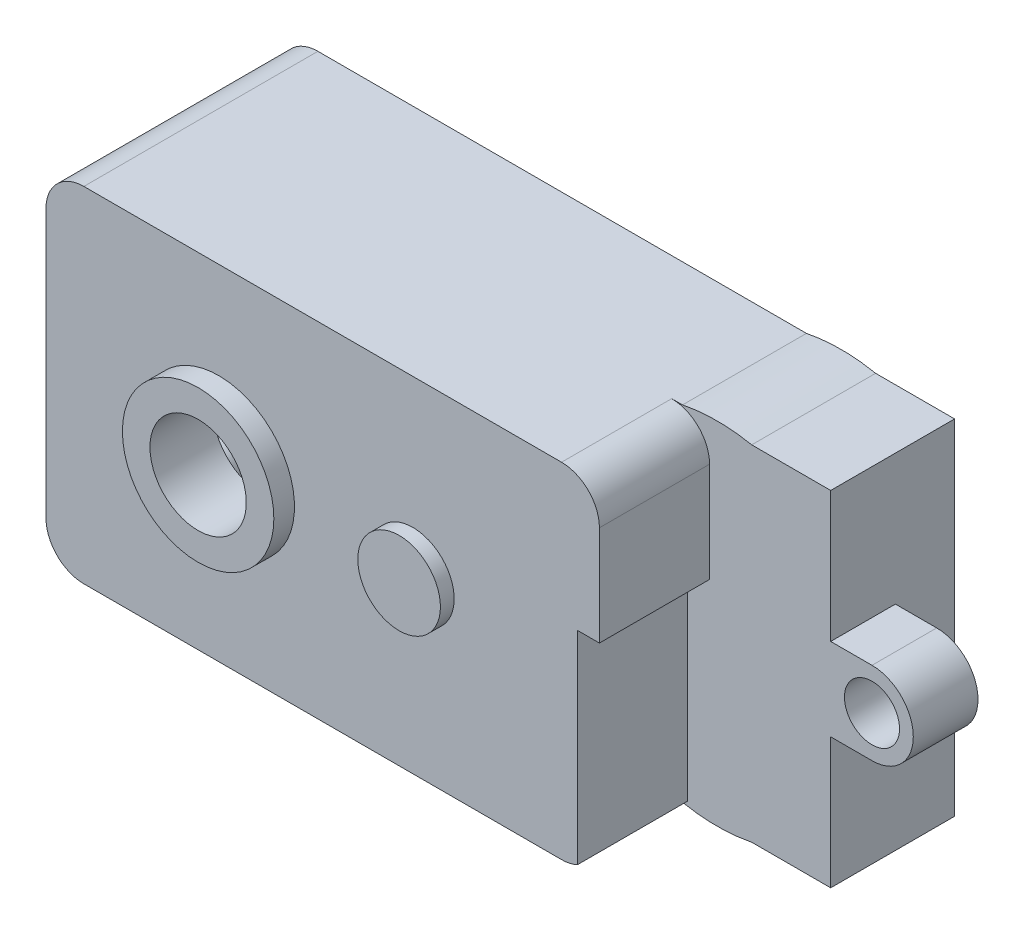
ISO-10303-21;
HEADER;
FILE_DESCRIPTION(('STEP AP214'),'2;1');
FILE_NAME('part.step','',(''),(''),'','','');
FILE_SCHEMA(('AUTOMOTIVE_DESIGN { 1 0 10303 214 1 1 1 1 }'));
ENDSEC;
DATA;
#1=APPLICATION_CONTEXT('core data for automotive mechanical design processes');
#2=APPLICATION_PROTOCOL_DEFINITION('international standard','automotive_design',2000,#1);
#3=PRODUCT_CONTEXT('',#1,'mechanical');
#4=PRODUCT('Part','Part','',(#3));
#5=PRODUCT_RELATED_PRODUCT_CATEGORY('part','',(#4));
#6=PRODUCT_DEFINITION_FORMATION('','',#4);
#7=PRODUCT_DEFINITION_CONTEXT('part definition',#1,'design');
#8=PRODUCT_DEFINITION('design','',#6,#7);
#9=PRODUCT_DEFINITION_SHAPE('','',#8);
#10=(LENGTH_UNIT() NAMED_UNIT(*) SI_UNIT(.MILLI.,.METRE.));
#11=(NAMED_UNIT(*) PLANE_ANGLE_UNIT() SI_UNIT($,.RADIAN.));
#12=(NAMED_UNIT(*) SI_UNIT($,.STERADIAN.) SOLID_ANGLE_UNIT());
#13=UNCERTAINTY_MEASURE_WITH_UNIT(LENGTH_MEASURE(1.E-05),#10,'distance_accuracy_value','');
#14=(GEOMETRIC_REPRESENTATION_CONTEXT(3) GLOBAL_UNCERTAINTY_ASSIGNED_CONTEXT((#13)) GLOBAL_UNIT_ASSIGNED_CONTEXT((#10,
#11,#12)) REPRESENTATION_CONTEXT('',''));
#15=CARTESIAN_POINT('',(0.,0.,0.));
#16=DIRECTION('',(0.,0.,1.));
#17=DIRECTION('',(1.,0.,0.));
#18=AXIS2_PLACEMENT_3D('',#15,#16,#17);
#19=CARTESIAN_POINT('',(3.,12.5,4.3));
#20=DIRECTION('',(0.,0.,1.));
#21=DIRECTION('',(1.,0.,0.));
#22=AXIS2_PLACEMENT_3D('',#19,#20,#21);
#23=CYLINDRICAL_SURFACE('',#22,1.25);
#24=CARTESIAN_POINT('',(3.,12.5,4.3));
#25=DIRECTION('',(0.,0.,1.));
#26=DIRECTION('',(1.,0.,0.));
#27=AXIS2_PLACEMENT_3D('',#24,#25,#26);
#28=CIRCLE('',#27,1.25);
#29=CARTESIAN_POINT('',(4.25,12.5,4.3));
#30=VERTEX_POINT('',#29);
#31=EDGE_CURVE('E324',#30,#30,#28,.T.);
#32=ORIENTED_EDGE('',*,*,#31,.F.);
#33=EDGE_LOOP('',(#32));
#34=FACE_BOUND('',#33,.T.);
#35=CARTESIAN_POINT('',(3.,12.5,5.));
#36=DIRECTION('',(0.,0.,1.));
#37=DIRECTION('',(1.,0.,0.));
#38=AXIS2_PLACEMENT_3D('',#35,#36,#37);
#39=CIRCLE('',#38,1.25);
#40=CARTESIAN_POINT('',(4.25,12.5,5.));
#41=VERTEX_POINT('',#40);
#42=EDGE_CURVE('E37',#41,#41,#39,.F.);
#43=ORIENTED_EDGE('',*,*,#42,.F.);
#44=EDGE_LOOP('',(#43));
#45=FACE_BOUND('',#44,.T.);
#46=ADVANCED_FACE('F33',(#34,#45),#23,.F.);
#47=CARTESIAN_POINT('',(-11.55,22.25,15.5));
#48=DIRECTION('',(0.,0.,-1.));
#49=DIRECTION('',(-1.,0.,0.));
#50=AXIS2_PLACEMENT_3D('',#47,#48,#49);
#51=PLANE('',#50);
#52=CARTESIAN_POINT('',(-22.35,12.5,15.5));
#53=DIRECTION('',(0.,0.,-1.));
#54=DIRECTION('',(-1.,0.,0.));
#55=AXIS2_PLACEMENT_3D('',#52,#53,#54);
#56=CIRCLE('',#55,3.);
#57=CARTESIAN_POINT('',(-25.35,12.5,15.5));
#58=VERTEX_POINT('',#57);
#59=EDGE_CURVE('E421',#58,#58,#56,.T.);
#60=ORIENTED_EDGE('',*,*,#59,.F.);
#61=EDGE_LOOP('',(#60));
#62=FACE_BOUND('',#61,.T.);
#63=CARTESIAN_POINT('',(-36.45,12.5,15.5));
#64=DIRECTION('',(0.,0.,-1.));
#65=DIRECTION('',(-1.,0.,0.));
#66=AXIS2_PLACEMENT_3D('',#63,#64,#65);
#67=CIRCLE('',#66,5.5);
#68=CARTESIAN_POINT('',(-41.95,12.5,15.5));
#69=VERTEX_POINT('',#68);
#70=EDGE_CURVE('E406',#69,#69,#67,.T.);
#71=ORIENTED_EDGE('',*,*,#70,.F.);
#72=EDGE_LOOP('',(#71));
#73=FACE_BOUND('',#72,.T.);
#74=DIRECTION('',(0.,-1.,0.));
#75=VECTOR('',#74,1.);
#76=CARTESIAN_POINT('',(-48.,22.25,15.5));
#77=LINE('',#76,#75);
#78=CARTESIAN_POINT('',(-48.,22.25,15.5));
#79=VERTEX_POINT('',#78);
#80=CARTESIAN_POINT('',(-48.,2.75,15.5));
#81=VERTEX_POINT('',#80);
#82=EDGE_CURVE('E465',#79,#81,#77,.T.);
#83=ORIENTED_EDGE('',*,*,#82,.F.);
#84=CARTESIAN_POINT('',(-46.25,22.25,15.5));
#85=DIRECTION('',(0.,0.,-1.));
#86=DIRECTION('',(-1.,0.,0.));
#87=AXIS2_PLACEMENT_3D('',#84,#85,#86);
#88=CIRCLE('',#87,1.75);
#89=CARTESIAN_POINT('',(-46.25,24.,15.5));
#90=VERTEX_POINT('',#89);
#91=EDGE_CURVE('E360',#90,#79,#88,.T.);
#92=ORIENTED_EDGE('',*,*,#91,.F.);
#93=DIRECTION('',(-1.,0.,0.));
#94=VECTOR('',#93,1.);
#95=CARTESIAN_POINT('',(-11.55,24.,15.5));
#96=LINE('',#95,#94);
#97=CARTESIAN_POINT('',(-11.55,24.,15.5));
#98=VERTEX_POINT('',#97);
#99=EDGE_CURVE('E453',#98,#90,#96,.T.);
#100=ORIENTED_EDGE('',*,*,#99,.F.);
#101=CARTESIAN_POINT('',(-11.55,22.25,15.5));
#102=DIRECTION('',(0.,0.,-1.));
#103=DIRECTION('',(-1.,0.,0.));
#104=AXIS2_PLACEMENT_3D('',#101,#102,#103);
#105=CIRCLE('',#104,1.75);
#106=CARTESIAN_POINT('',(-9.8,22.25,15.5));
#107=VERTEX_POINT('',#106);
#108=EDGE_CURVE('E457',#107,#98,#105,.F.);
#109=ORIENTED_EDGE('',*,*,#108,.F.);
#110=DIRECTION('',(0.,1.,0.));
#111=VECTOR('',#110,1.);
#112=CARTESIAN_POINT('',(-9.8,22.25,15.5));
#113=LINE('',#112,#111);
#114=CARTESIAN_POINT('',(-9.8,16.,15.5));
#115=VERTEX_POINT('',#114);
#116=EDGE_CURVE('E500',#115,#107,#113,.T.);
#117=ORIENTED_EDGE('',*,*,#116,.F.);
#118=DIRECTION('',(1.,0.,0.));
#119=VECTOR('',#118,1.);
#120=CARTESIAN_POINT('',(-11.55,16.,15.5));
#121=LINE('',#120,#119);
#122=CARTESIAN_POINT('',(-11.4,16.,15.5));
#123=VERTEX_POINT('',#122);
#124=EDGE_CURVE('E431',#123,#115,#121,.T.);
#125=ORIENTED_EDGE('',*,*,#124,.F.);
#126=DIRECTION('',(0.,-1.,0.));
#127=VECTOR('',#126,1.);
#128=CARTESIAN_POINT('',(-11.4,15.,15.5));
#129=LINE('',#128,#127);
#130=CARTESIAN_POINT('',(-11.4,1.00644042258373,15.5));
#131=VERTEX_POINT('',#130);
#132=EDGE_CURVE('E427',#123,#131,#129,.T.);
#133=ORIENTED_EDGE('',*,*,#132,.T.);
#134=CARTESIAN_POINT('',(-11.55,2.75,15.5));
#135=DIRECTION('',(0.,0.,-1.));
#136=DIRECTION('',(-1.,0.,0.));
#137=AXIS2_PLACEMENT_3D('',#134,#135,#136);
#138=CIRCLE('',#137,1.75);
#139=CARTESIAN_POINT('',(-11.55,1.,15.5));
#140=VERTEX_POINT('',#139);
#141=EDGE_CURVE('E477',#140,#131,#138,.F.);
#142=ORIENTED_EDGE('',*,*,#141,.F.);
#143=DIRECTION('',(1.,0.,0.));
#144=VECTOR('',#143,1.);
#145=CARTESIAN_POINT('',(-11.55,1.,15.5));
#146=LINE('',#145,#144);
#147=CARTESIAN_POINT('',(-46.25,1.,15.5));
#148=VERTEX_POINT('',#147);
#149=EDGE_CURVE('E467',#148,#140,#146,.T.);
#150=ORIENTED_EDGE('',*,*,#149,.F.);
#151=CARTESIAN_POINT('',(-46.25,2.75,15.5));
#152=DIRECTION('',(0.,0.,-1.));
#153=DIRECTION('',(-1.,0.,0.));
#154=AXIS2_PLACEMENT_3D('',#151,#152,#153);
#155=CIRCLE('',#154,1.75);
#156=EDGE_CURVE('E380',#81,#148,#155,.T.);
#157=ORIENTED_EDGE('',*,*,#156,.F.);
#158=EDGE_LOOP('',(#83,#92,#100,#109,#117,#125,#133,#142,#150,#157));
#159=FACE_BOUND('',#158,.T.);
#160=ADVANCED_FACE('F644',(#62,#73,#159),#51,.T.);
#161=CARTESIAN_POINT('',(-11.55,22.25,17.));
#162=DIRECTION('',(0.,0.,-1.));
#163=DIRECTION('',(-1.,0.,0.));
#164=AXIS2_PLACEMENT_3D('',#161,#162,#163);
#165=PLANE('',#164);
#166=CARTESIAN_POINT('',(-22.35,12.5,17.));
#167=DIRECTION('',(0.,0.,-1.));
#168=DIRECTION('',(-1.,0.,0.));
#169=AXIS2_PLACEMENT_3D('',#166,#167,#168);
#170=CIRCLE('',#169,3.);
#171=CARTESIAN_POINT('',(-25.35,12.5,17.));
#172=VERTEX_POINT('',#171);
#173=EDGE_CURVE('E594',#172,#172,#170,.F.);
#174=ORIENTED_EDGE('',*,*,#173,.F.);
#175=EDGE_LOOP('',(#174));
#176=FACE_BOUND('',#175,.T.);
#177=DIRECTION('',(-1.,0.,0.));
#178=VECTOR('',#177,1.);
#179=CARTESIAN_POINT('',(-49.,25.,17.));
#180=LINE('',#179,#178);
#181=CARTESIAN_POINT('',(-11.55,25.,17.));
#182=VERTEX_POINT('',#181);
#183=CARTESIAN_POINT('',(-46.25,25.,17.));
#184=VERTEX_POINT('',#183);
#185=EDGE_CURVE('E569',#182,#184,#180,.T.);
#186=ORIENTED_EDGE('',*,*,#185,.T.);
#187=CARTESIAN_POINT('',(-46.25,22.25,17.));
#188=DIRECTION('',(0.,0.,-1.));
#189=DIRECTION('',(-1.,0.,0.));
#190=AXIS2_PLACEMENT_3D('',#187,#188,#189);
#191=CIRCLE('',#190,2.75);
#192=CARTESIAN_POINT('',(-49.,22.25,17.));
#193=VERTEX_POINT('',#192);
#194=EDGE_CURVE('E589',#184,#193,#191,.F.);
#195=ORIENTED_EDGE('',*,*,#194,.T.);
#196=DIRECTION('',(0.,-1.,0.));
#197=VECTOR('',#196,1.);
#198=CARTESIAN_POINT('',(-49.,0.,17.));
#199=LINE('',#198,#197);
#200=CARTESIAN_POINT('',(-49.,2.75,17.));
#201=VERTEX_POINT('',#200);
#202=EDGE_CURVE('E557',#193,#201,#199,.T.);
#203=ORIENTED_EDGE('',*,*,#202,.T.);
#204=CARTESIAN_POINT('',(-46.25,2.75,17.));
#205=DIRECTION('',(0.,0.,-1.));
#206=DIRECTION('',(-1.,0.,0.));
#207=AXIS2_PLACEMENT_3D('',#204,#205,#206);
#208=CIRCLE('',#207,2.75);
#209=CARTESIAN_POINT('',(-46.25,0.,17.));
#210=VERTEX_POINT('',#209);
#211=EDGE_CURVE('E587',#201,#210,#208,.F.);
#212=ORIENTED_EDGE('',*,*,#211,.T.);
#213=DIRECTION('',(1.,0.,0.));
#214=VECTOR('',#213,1.);
#215=CARTESIAN_POINT('',(-11.55,0.,17.));
#216=LINE('',#215,#214);
#217=CARTESIAN_POINT('',(-11.55,0.,17.));
#218=VERTEX_POINT('',#217);
#219=EDGE_CURVE('E865',#210,#218,#216,.T.);
#220=ORIENTED_EDGE('',*,*,#219,.T.);
#221=CARTESIAN_POINT('',(-11.55,2.75,17.));
#222=DIRECTION('',(0.,0.,1.));
#223=DIRECTION('',(-1.,0.,0.));
#224=AXIS2_PLACEMENT_3D('',#221,#222,#223);
#225=CIRCLE('',#224,2.75);
#226=CARTESIAN_POINT('',(-10.4,0.252000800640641,17.));
#227=VERTEX_POINT('',#226);
#228=EDGE_CURVE('E863',#218,#227,#225,.T.);
#229=ORIENTED_EDGE('',*,*,#228,.T.);
#230=DIRECTION('',(0.,-1.,0.));
#231=VECTOR('',#230,1.);
#232=CARTESIAN_POINT('',(-10.4,15.,17.));
#233=LINE('',#232,#231);
#234=CARTESIAN_POINT('',(-10.4,15.,17.));
#235=VERTEX_POINT('',#234);
#236=EDGE_CURVE('E504',#235,#227,#233,.T.);
#237=ORIENTED_EDGE('',*,*,#236,.F.);
#238=DIRECTION('',(1.,0.,0.));
#239=VECTOR('',#238,1.);
#240=CARTESIAN_POINT('',(-11.55,15.,17.));
#241=LINE('',#240,#239);
#242=CARTESIAN_POINT('',(-8.8,15.,17.));
#243=VERTEX_POINT('',#242);
#244=EDGE_CURVE('E572',#235,#243,#241,.T.);
#245=ORIENTED_EDGE('',*,*,#244,.T.);
#246=DIRECTION('',(0.,1.,0.));
#247=VECTOR('',#246,1.);
#248=CARTESIAN_POINT('',(-8.8,22.25,17.));
#249=LINE('',#248,#247);
#250=CARTESIAN_POINT('',(-8.8,22.25,17.));
#251=VERTEX_POINT('',#250);
#252=EDGE_CURVE('E861',#243,#251,#249,.T.);
#253=ORIENTED_EDGE('',*,*,#252,.T.);
#254=CARTESIAN_POINT('',(-11.55,22.25,17.));
#255=DIRECTION('',(0.,0.,1.));
#256=DIRECTION('',(-1.,0.,0.));
#257=AXIS2_PLACEMENT_3D('',#254,#255,#256);
#258=CIRCLE('',#257,2.75);
#259=EDGE_CURVE('E859',#251,#182,#258,.T.);
#260=ORIENTED_EDGE('',*,*,#259,.T.);
#261=EDGE_LOOP('',(#186,#195,#203,#212,#220,#229,#237,#245,#253,#260));
#262=FACE_BOUND('',#261,.T.);
#263=CARTESIAN_POINT('',(-36.45,12.5,17.));
#264=DIRECTION('',(0.,0.,-1.));
#265=DIRECTION('',(-1.,0.,0.));
#266=AXIS2_PLACEMENT_3D('',#263,#264,#265);
#267=CIRCLE('',#266,5.5);
#268=CARTESIAN_POINT('',(-41.95,12.5,17.));
#269=VERTEX_POINT('',#268);
#270=EDGE_CURVE('E597',#269,#269,#267,.F.);
#271=ORIENTED_EDGE('',*,*,#270,.F.);
#272=EDGE_LOOP('',(#271));
#273=FACE_BOUND('',#272,.T.);
#274=ADVANCED_FACE('F720',(#176,#262,#273),#165,.F.);
#275=CARTESIAN_POINT('',(0.,0.,9.));
#276=DIRECTION('',(-1.,0.,0.));
#277=DIRECTION('',(0.,0.,1.));
#278=AXIS2_PLACEMENT_3D('',#275,#276,#277);
#279=PLANE('',#278);
#280=DIRECTION('',(0.,1.,0.));
#281=VECTOR('',#280,1.);
#282=CARTESIAN_POINT('',(0.,0.,4.3));
#283=LINE('',#282,#281);
#284=CARTESIAN_POINT('',(0.,9.5,4.3));
#285=VERTEX_POINT('',#284);
#286=CARTESIAN_POINT('',(0.,15.5,4.3));
#287=VERTEX_POINT('',#286);
#288=EDGE_CURVE('E355',#285,#287,#283,.T.);
#289=ORIENTED_EDGE('',*,*,#288,.F.);
#290=DIRECTION('',(0.,0.,1.));
#291=VECTOR('',#290,1.);
#292=CARTESIAN_POINT('',(0.,9.5,9.));
#293=LINE('',#292,#291);
#294=CARTESIAN_POINT('',(0.,9.5,9.));
#295=VERTEX_POINT('',#294);
#296=EDGE_CURVE('E352',#285,#295,#293,.T.);
#297=ORIENTED_EDGE('',*,*,#296,.T.);
#298=DIRECTION('',(0.,1.,0.));
#299=VECTOR('',#298,1.);
#300=CARTESIAN_POINT('',(0.,0.,9.));
#301=LINE('',#300,#299);
#302=CARTESIAN_POINT('',(0.,0.,9.));
#303=VERTEX_POINT('',#302);
#304=EDGE_CURVE('E827',#303,#295,#301,.T.);
#305=ORIENTED_EDGE('',*,*,#304,.F.);
#306=DIRECTION('',(0.,0.,-1.));
#307=VECTOR('',#306,1.);
#308=CARTESIAN_POINT('',(0.,0.,9.));
#309=LINE('',#308,#307);
#310=CARTESIAN_POINT('',(0.,0.,0.));
#311=VERTEX_POINT('',#310);
#312=EDGE_CURVE('E892',#303,#311,#309,.T.);
#313=ORIENTED_EDGE('',*,*,#312,.T.);
#314=DIRECTION('',(0.,1.,0.));
#315=VECTOR('',#314,1.);
#316=CARTESIAN_POINT('',(0.,0.,0.));
#317=LINE('',#316,#315);
#318=CARTESIAN_POINT('',(0.,25.,0.));
#319=VERTEX_POINT('',#318);
#320=EDGE_CURVE('E802',#311,#319,#317,.T.);
#321=ORIENTED_EDGE('',*,*,#320,.T.);
#322=DIRECTION('',(0.,0.,-1.));
#323=VECTOR('',#322,1.);
#324=CARTESIAN_POINT('',(0.,25.,9.));
#325=LINE('',#324,#323);
#326=CARTESIAN_POINT('',(0.,25.,9.));
#327=VERTEX_POINT('',#326);
#328=EDGE_CURVE('E576',#327,#319,#325,.T.);
#329=ORIENTED_EDGE('',*,*,#328,.F.);
#330=CARTESIAN_POINT('',(0.,15.5,9.));
#331=VERTEX_POINT('',#330);
#332=EDGE_CURVE('E826',#331,#327,#301,.T.);
#333=ORIENTED_EDGE('',*,*,#332,.F.);
#334=DIRECTION('',(0.,0.,-1.));
#335=VECTOR('',#334,1.);
#336=CARTESIAN_POINT('',(0.,15.5,9.));
#337=LINE('',#336,#335);
#338=EDGE_CURVE('E317',#331,#287,#337,.T.);
#339=ORIENTED_EDGE('',*,*,#338,.T.);
#340=EDGE_LOOP('',(#289,#297,#305,#313,#321,#329,#333,#339));
#341=FACE_BOUND('',#340,.T.);
#342=ADVANCED_FACE('F35',(#341),#279,.F.);
#343=CARTESIAN_POINT('',(0.,25.,9.));
#344=DIRECTION('',(0.,-1.,0.));
#345=DIRECTION('',(0.,0.,-1.));
#346=AXIS2_PLACEMENT_3D('',#343,#344,#345);
#347=PLANE('',#346);
#348=DIRECTION('',(-1.,0.,0.));
#349=VECTOR('',#348,1.);
#350=CARTESIAN_POINT('',(0.,25.,0.));
#351=LINE('',#350,#349);
#352=CARTESIAN_POINT('',(-5.7375310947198,25.,0.));
#353=VERTEX_POINT('',#352);
#354=EDGE_CURVE('E792',#319,#353,#351,.T.);
#355=ORIENTED_EDGE('',*,*,#354,.T.);
#356=DIRECTION('',(0.,0.,-1.));
#357=VECTOR('',#356,1.);
#358=CARTESIAN_POINT('',(-5.7375310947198,25.,9.));
#359=LINE('',#358,#357);
#360=CARTESIAN_POINT('',(-5.7375310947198,25.,9.));
#361=VERTEX_POINT('',#360);
#362=EDGE_CURVE('E795',#361,#353,#359,.T.);
#363=ORIENTED_EDGE('',*,*,#362,.F.);
#364=DIRECTION('',(-1.,0.,0.));
#365=VECTOR('',#364,1.);
#366=CARTESIAN_POINT('',(0.,25.,9.));
#367=LINE('',#366,#365);
#368=EDGE_CURVE('E829',#327,#361,#367,.T.);
#369=ORIENTED_EDGE('',*,*,#368,.F.);
#370=ORIENTED_EDGE('',*,*,#328,.T.);
#371=EDGE_LOOP('',(#355,#363,#369,#370));
#372=FACE_BOUND('',#371,.T.);
#373=ADVANCED_FACE('F782',(#372),#347,.F.);
#374=CARTESIAN_POINT('',(-8.25,12.5,9.));
#375=DIRECTION('',(0.,0.,-1.));
#376=DIRECTION('',(-1.,0.,0.));
#377=AXIS2_PLACEMENT_3D('',#374,#375,#376);
#378=CYLINDRICAL_SURFACE('',#377,12.75);
#379=CARTESIAN_POINT('',(-8.25,12.5,0.));
#380=DIRECTION('',(0.,0.,1.));
#381=DIRECTION('',(1.,0.,0.));
#382=AXIS2_PLACEMENT_3D('',#379,#380,#381);
#383=CIRCLE('',#382,12.75);
#384=CARTESIAN_POINT('',(-10.7624689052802,25.,0.));
#385=VERTEX_POINT('',#384);
#386=EDGE_CURVE('E801',#353,#385,#383,.T.);
#387=ORIENTED_EDGE('',*,*,#386,.T.);
#388=DIRECTION('',(0.,0.,-1.));
#389=VECTOR('',#388,1.);
#390=CARTESIAN_POINT('',(-10.7624689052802,25.,9.));
#391=LINE('',#390,#389);
#392=CARTESIAN_POINT('',(-10.7624689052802,25.,9.));
#393=VERTEX_POINT('',#392);
#394=EDGE_CURVE('E807',#393,#385,#391,.T.);
#395=ORIENTED_EDGE('',*,*,#394,.F.);
#396=CARTESIAN_POINT('',(-8.25,12.5,9.));
#397=DIRECTION('',(0.,0.,1.));
#398=DIRECTION('',(1.,0.,0.));
#399=AXIS2_PLACEMENT_3D('',#396,#397,#398);
#400=CIRCLE('',#399,12.75);
#401=EDGE_CURVE('E806',#361,#393,#400,.T.);
#402=ORIENTED_EDGE('',*,*,#401,.F.);
#403=ORIENTED_EDGE('',*,*,#362,.T.);
#404=EDGE_LOOP('',(#387,#395,#402,#403));
#405=FACE_BOUND('',#404,.T.);
#406=ADVANCED_FACE('F779',(#405),#378,.T.);
#407=CARTESIAN_POINT('',(-10.7624689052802,25.,9.));
#408=DIRECTION('',(0.,-1.,0.));
#409=DIRECTION('',(0.,0.,-1.));
#410=AXIS2_PLACEMENT_3D('',#407,#408,#409);
#411=PLANE('',#410);
#412=DIRECTION('',(-1.,0.,0.));
#413=VECTOR('',#412,1.);
#414=CARTESIAN_POINT('',(-10.7624689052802,25.,0.));
#415=LINE('',#414,#413);
#416=CARTESIAN_POINT('',(-46.25,25.,0.));
#417=VERTEX_POINT('',#416);
#418=EDGE_CURVE('E812',#385,#417,#415,.T.);
#419=ORIENTED_EDGE('',*,*,#418,.T.);
#420=DIRECTION('',(0.,0.,-1.));
#421=VECTOR('',#420,1.);
#422=CARTESIAN_POINT('',(-46.25,25.,9.));
#423=LINE('',#422,#421);
#424=EDGE_CURVE('E585',#417,#184,#423,.F.);
#425=ORIENTED_EDGE('',*,*,#424,.T.);
#426=ORIENTED_EDGE('',*,*,#185,.F.);
#427=DIRECTION('',(0.,0.,-1.));
#428=VECTOR('',#427,1.);
#429=CARTESIAN_POINT('',(-11.55,25.,17.));
#430=LINE('',#429,#428);
#431=CARTESIAN_POINT('',(-11.55,25.,9.));
#432=VERTEX_POINT('',#431);
#433=EDGE_CURVE('E565',#182,#432,#430,.T.);
#434=ORIENTED_EDGE('',*,*,#433,.T.);
#435=DIRECTION('',(-1.,0.,0.));
#436=VECTOR('',#435,1.);
#437=CARTESIAN_POINT('',(-10.7624689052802,25.,9.));
#438=LINE('',#437,#436);
#439=EDGE_CURVE('E832',#393,#432,#438,.T.);
#440=ORIENTED_EDGE('',*,*,#439,.F.);
#441=ORIENTED_EDGE('',*,*,#394,.T.);
#442=EDGE_LOOP('',(#419,#425,#426,#434,#440,#441));
#443=FACE_BOUND('',#442,.T.);
#444=ADVANCED_FACE('F775',(#443),#411,.F.);
#445=CARTESIAN_POINT('',(-49.,0.,9.));
#446=DIRECTION('',(1.,0.,0.));
#447=DIRECTION('',(0.,0.,-1.));
#448=AXIS2_PLACEMENT_3D('',#445,#446,#447);
#449=PLANE('',#448);
#450=ORIENTED_EDGE('',*,*,#202,.F.);
#451=DIRECTION('',(0.,0.,-1.));
#452=VECTOR('',#451,1.);
#453=CARTESIAN_POINT('',(-49.,22.25,9.));
#454=LINE('',#453,#452);
#455=CARTESIAN_POINT('',(-49.,22.25,0.));
#456=VERTEX_POINT('',#455);
#457=EDGE_CURVE('E578',#193,#456,#454,.T.);
#458=ORIENTED_EDGE('',*,*,#457,.T.);
#459=DIRECTION('',(0.,-1.,0.));
#460=VECTOR('',#459,1.);
#461=CARTESIAN_POINT('',(-49.,0.,0.));
#462=LINE('',#461,#460);
#463=CARTESIAN_POINT('',(-49.,2.75,0.));
#464=VERTEX_POINT('',#463);
#465=EDGE_CURVE('E814',#456,#464,#462,.T.);
#466=ORIENTED_EDGE('',*,*,#465,.T.);
#467=DIRECTION('',(0.,0.,-1.));
#468=VECTOR('',#467,1.);
#469=CARTESIAN_POINT('',(-49.,2.75,9.));
#470=LINE('',#469,#468);
#471=EDGE_CURVE('E575',#464,#201,#470,.F.);
#472=ORIENTED_EDGE('',*,*,#471,.T.);
#473=EDGE_LOOP('',(#450,#458,#466,#472));
#474=FACE_BOUND('',#473,.T.);
#475=ADVANCED_FACE('F771',(#474),#449,.F.);
#476=CARTESIAN_POINT('',(-10.7624689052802,0.,9.));
#477=DIRECTION('',(0.,1.,0.));
#478=DIRECTION('',(0.,0.,1.));
#479=AXIS2_PLACEMENT_3D('',#476,#477,#478);
#480=PLANE('',#479);
#481=ORIENTED_EDGE('',*,*,#219,.F.);
#482=DIRECTION('',(0.,0.,-1.));
#483=VECTOR('',#482,1.);
#484=CARTESIAN_POINT('',(-46.25,0.,9.));
#485=LINE('',#484,#483);
#486=CARTESIAN_POINT('',(-46.25,0.,0.));
#487=VERTEX_POINT('',#486);
#488=EDGE_CURVE('E591',#210,#487,#485,.T.);
#489=ORIENTED_EDGE('',*,*,#488,.T.);
#490=DIRECTION('',(1.,0.,0.));
#491=VECTOR('',#490,1.);
#492=CARTESIAN_POINT('',(-10.7624689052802,0.,0.));
#493=LINE('',#492,#491);
#494=CARTESIAN_POINT('',(-10.7624689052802,0.,0.));
#495=VERTEX_POINT('',#494);
#496=EDGE_CURVE('E820',#487,#495,#493,.T.);
#497=ORIENTED_EDGE('',*,*,#496,.T.);
#498=DIRECTION('',(0.,0.,-1.));
#499=VECTOR('',#498,1.);
#500=CARTESIAN_POINT('',(-10.7624689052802,0.,9.));
#501=LINE('',#500,#499);
#502=CARTESIAN_POINT('',(-10.7624689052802,0.,9.));
#503=VERTEX_POINT('',#502);
#504=EDGE_CURVE('E888',#503,#495,#501,.T.);
#505=ORIENTED_EDGE('',*,*,#504,.F.);
#506=DIRECTION('',(1.,0.,0.));
#507=VECTOR('',#506,1.);
#508=CARTESIAN_POINT('',(-10.7624689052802,0.,9.));
#509=LINE('',#508,#507);
#510=CARTESIAN_POINT('',(-11.55,0.,9.));
#511=VERTEX_POINT('',#510);
#512=EDGE_CURVE('E840',#511,#503,#509,.T.);
#513=ORIENTED_EDGE('',*,*,#512,.F.);
#514=DIRECTION('',(0.,0.,-1.));
#515=VECTOR('',#514,1.);
#516=CARTESIAN_POINT('',(-11.55,0.,17.));
#517=LINE('',#516,#515);
#518=EDGE_CURVE('E846',#218,#511,#517,.T.);
#519=ORIENTED_EDGE('',*,*,#518,.F.);
#520=EDGE_LOOP('',(#481,#489,#497,#505,#513,#519));
#521=FACE_BOUND('',#520,.T.);
#522=ADVANCED_FACE('F767',(#521),#480,.F.);
#523=CARTESIAN_POINT('',(-8.25,12.5,9.));
#524=DIRECTION('',(0.,0.,-1.));
#525=DIRECTION('',(-1.,0.,0.));
#526=AXIS2_PLACEMENT_3D('',#523,#524,#525);
#527=CYLINDRICAL_SURFACE('',#526,12.75);
#528=CARTESIAN_POINT('',(-8.25,12.5,0.));
#529=DIRECTION('',(0.,0.,1.));
#530=DIRECTION('',(1.,0.,0.));
#531=AXIS2_PLACEMENT_3D('',#528,#529,#530);
#532=CIRCLE('',#531,12.75);
#533=CARTESIAN_POINT('',(-5.7375310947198,0.,0.));
#534=VERTEX_POINT('',#533);
#535=EDGE_CURVE('E822',#495,#534,#532,.T.);
#536=ORIENTED_EDGE('',*,*,#535,.T.);
#537=DIRECTION('',(0.,0.,-1.));
#538=VECTOR('',#537,1.);
#539=CARTESIAN_POINT('',(-5.7375310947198,0.,9.));
#540=LINE('',#539,#538);
#541=CARTESIAN_POINT('',(-5.7375310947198,0.,9.));
#542=VERTEX_POINT('',#541);
#543=EDGE_CURVE('E886',#542,#534,#540,.T.);
#544=ORIENTED_EDGE('',*,*,#543,.F.);
#545=CARTESIAN_POINT('',(-8.25,12.5,9.));
#546=DIRECTION('',(0.,0.,1.));
#547=DIRECTION('',(1.,0.,0.));
#548=AXIS2_PLACEMENT_3D('',#545,#546,#547);
#549=CIRCLE('',#548,12.75);
#550=EDGE_CURVE('E842',#503,#542,#549,.T.);
#551=ORIENTED_EDGE('',*,*,#550,.F.);
#552=ORIENTED_EDGE('',*,*,#504,.T.);
#553=EDGE_LOOP('',(#536,#544,#551,#552));
#554=FACE_BOUND('',#553,.T.);
#555=ADVANCED_FACE('F760',(#554),#527,.T.);
#556=CARTESIAN_POINT('',(-5.7375310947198,0.,9.));
#557=DIRECTION('',(0.,1.,0.));
#558=DIRECTION('',(0.,0.,1.));
#559=AXIS2_PLACEMENT_3D('',#556,#557,#558);
#560=PLANE('',#559);
#561=DIRECTION('',(1.,0.,0.));
#562=VECTOR('',#561,1.);
#563=CARTESIAN_POINT('',(-5.7375310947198,0.,0.));
#564=LINE('',#563,#562);
#565=EDGE_CURVE('E824',#534,#311,#564,.T.);
#566=ORIENTED_EDGE('',*,*,#565,.T.);
#567=ORIENTED_EDGE('',*,*,#312,.F.);
#568=DIRECTION('',(1.,0.,0.));
#569=VECTOR('',#568,1.);
#570=CARTESIAN_POINT('',(-5.7375310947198,0.,9.));
#571=LINE('',#570,#569);
#572=EDGE_CURVE('E891',#542,#303,#571,.T.);
#573=ORIENTED_EDGE('',*,*,#572,.F.);
#574=ORIENTED_EDGE('',*,*,#543,.T.);
#575=EDGE_LOOP('',(#566,#567,#573,#574));
#576=FACE_BOUND('',#575,.T.);
#577=ADVANCED_FACE('F752',(#576),#560,.F.);
#578=CARTESIAN_POINT('',(-8.25,12.5,9.));
#579=DIRECTION('',(0.,0.,1.));
#580=DIRECTION('',(1.,0.,0.));
#581=AXIS2_PLACEMENT_3D('',#578,#579,#580);
#582=PLANE('',#581);
#583=CARTESIAN_POINT('',(3.,12.5,9.));
#584=DIRECTION('',(0.,0.,1.));
#585=DIRECTION('',(1.,0.,0.));
#586=AXIS2_PLACEMENT_3D('',#583,#584,#585);
#587=CIRCLE('',#586,2.);
#588=CARTESIAN_POINT('',(5.,12.5,9.));
#589=VERTEX_POINT('',#588);
#590=EDGE_CURVE('E745',#589,#589,#587,.T.);
#591=ORIENTED_EDGE('',*,*,#590,.F.);
#592=EDGE_LOOP('',(#591));
#593=FACE_BOUND('',#592,.T.);
#594=ORIENTED_EDGE('',*,*,#304,.T.);
#595=DIRECTION('',(1.,0.,0.));
#596=VECTOR('',#595,1.);
#597=CARTESIAN_POINT('',(-2.64712898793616,9.5,9.));
#598=LINE('',#597,#596);
#599=CARTESIAN_POINT('',(3.,9.5,9.));
#600=VERTEX_POINT('',#599);
#601=EDGE_CURVE('E319',#295,#600,#598,.T.);
#602=ORIENTED_EDGE('',*,*,#601,.T.);
#603=CARTESIAN_POINT('',(3.,12.5,9.));
#604=DIRECTION('',(0.,0.,1.));
#605=DIRECTION('',(1.,0.,0.));
#606=AXIS2_PLACEMENT_3D('',#603,#604,#605);
#607=CIRCLE('',#606,3.);
#608=CARTESIAN_POINT('',(3.,15.5,9.));
#609=VERTEX_POINT('',#608);
#610=EDGE_CURVE('E307',#600,#609,#607,.T.);
#611=ORIENTED_EDGE('',*,*,#610,.T.);
#612=DIRECTION('',(-1.,0.,0.));
#613=VECTOR('',#612,1.);
#614=CARTESIAN_POINT('',(3.,15.5,9.));
#615=LINE('',#614,#613);
#616=EDGE_CURVE('E49',#609,#331,#615,.T.);
#617=ORIENTED_EDGE('',*,*,#616,.T.);
#618=ORIENTED_EDGE('',*,*,#332,.T.);
#619=ORIENTED_EDGE('',*,*,#368,.T.);
#620=ORIENTED_EDGE('',*,*,#401,.T.);
#621=ORIENTED_EDGE('',*,*,#439,.T.);
#622=CARTESIAN_POINT('',(-11.55,22.25,9.));
#623=DIRECTION('',(0.,0.,1.));
#624=DIRECTION('',(-1.,0.,0.));
#625=AXIS2_PLACEMENT_3D('',#622,#623,#624);
#626=CIRCLE('',#625,2.75);
#627=CARTESIAN_POINT('',(-8.8,22.25,9.));
#628=VERTEX_POINT('',#627);
#629=EDGE_CURVE('E554',#628,#432,#626,.T.);
#630=ORIENTED_EDGE('',*,*,#629,.F.);
#631=DIRECTION('',(0.,1.,0.));
#632=VECTOR('',#631,1.);
#633=CARTESIAN_POINT('',(-8.8,22.25,9.));
#634=LINE('',#633,#632);
#635=CARTESIAN_POINT('',(-8.8,15.,9.));
#636=VERTEX_POINT('',#635);
#637=EDGE_CURVE('E552',#636,#628,#634,.T.);
#638=ORIENTED_EDGE('',*,*,#637,.F.);
#639=DIRECTION('',(-1.,0.,0.));
#640=VECTOR('',#639,1.);
#641=CARTESIAN_POINT('',(-10.4,15.,9.));
#642=LINE('',#641,#640);
#643=CARTESIAN_POINT('',(-10.4,15.,9.));
#644=VERTEX_POINT('',#643);
#645=EDGE_CURVE('E540',#636,#644,#642,.T.);
#646=ORIENTED_EDGE('',*,*,#645,.T.);
#647=DIRECTION('',(0.,-1.,0.));
#648=VECTOR('',#647,1.);
#649=CARTESIAN_POINT('',(-10.4,15.,9.));
#650=LINE('',#649,#648);
#651=CARTESIAN_POINT('',(-10.4,0.252000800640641,9.));
#652=VERTEX_POINT('',#651);
#653=EDGE_CURVE('E537',#644,#652,#650,.T.);
#654=ORIENTED_EDGE('',*,*,#653,.T.);
#655=CARTESIAN_POINT('',(-11.55,2.75,9.));
#656=DIRECTION('',(0.,0.,1.));
#657=DIRECTION('',(-1.,0.,0.));
#658=AXIS2_PLACEMENT_3D('',#655,#656,#657);
#659=CIRCLE('',#658,2.75);
#660=EDGE_CURVE('E551',#511,#652,#659,.T.);
#661=ORIENTED_EDGE('',*,*,#660,.F.);
#662=ORIENTED_EDGE('',*,*,#512,.T.);
#663=ORIENTED_EDGE('',*,*,#550,.T.);
#664=ORIENTED_EDGE('',*,*,#572,.T.);
#665=EDGE_LOOP('',(#594,#602,#611,#617,#618,#619,#620,#621,#630,#638,#646,#654,#661,#662,#663,#664));
#666=FACE_BOUND('',#665,.T.);
#667=ADVANCED_FACE('F322',(#593,#666),#582,.T.);
#668=CARTESIAN_POINT('',(-8.25,12.5,0.));
#669=DIRECTION('',(0.,0.,1.));
#670=DIRECTION('',(1.,0.,0.));
#671=AXIS2_PLACEMENT_3D('',#668,#669,#670);
#672=PLANE('',#671);
#673=DIRECTION('',(1.,0.,0.));
#674=VECTOR('',#673,1.);
#675=CARTESIAN_POINT('',(-5.7375310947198,1.,0.));
#676=LINE('',#675,#674);
#677=CARTESIAN_POINT('',(-5.83908730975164,1.,0.));
#678=VERTEX_POINT('',#677);
#679=CARTESIAN_POINT('',(-1.,1.,0.));
#680=VERTEX_POINT('',#679);
#681=EDGE_CURVE('E516',#678,#680,#676,.T.);
#682=ORIENTED_EDGE('',*,*,#681,.T.);
#683=DIRECTION('',(0.,1.,0.));
#684=VECTOR('',#683,1.);
#685=CARTESIAN_POINT('',(-1.,0.,0.));
#686=LINE('',#685,#684);
#687=CARTESIAN_POINT('',(-1.,24.,0.));
#688=VERTEX_POINT('',#687);
#689=EDGE_CURVE('E475',#680,#688,#686,.T.);
#690=ORIENTED_EDGE('',*,*,#689,.T.);
#691=DIRECTION('',(-1.,0.,0.));
#692=VECTOR('',#691,1.);
#693=CARTESIAN_POINT('',(0.,24.,0.));
#694=LINE('',#693,#692);
#695=CARTESIAN_POINT('',(-5.83908730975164,24.,0.));
#696=VERTEX_POINT('',#695);
#697=EDGE_CURVE('E515',#688,#696,#694,.T.);
#698=ORIENTED_EDGE('',*,*,#697,.T.);
#699=CARTESIAN_POINT('',(-8.25,12.5,0.));
#700=DIRECTION('',(0.,0.,1.));
#701=DIRECTION('',(1.,0.,0.));
#702=AXIS2_PLACEMENT_3D('',#699,#700,#701);
#703=CIRCLE('',#702,11.75);
#704=CARTESIAN_POINT('',(-10.6609126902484,24.,0.));
#705=VERTEX_POINT('',#704);
#706=EDGE_CURVE('E531',#696,#705,#703,.T.);
#707=ORIENTED_EDGE('',*,*,#706,.T.);
#708=DIRECTION('',(-1.,0.,0.));
#709=VECTOR('',#708,1.);
#710=CARTESIAN_POINT('',(-10.7624689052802,24.,0.));
#711=LINE('',#710,#709);
#712=CARTESIAN_POINT('',(-48.,24.,0.));
#713=VERTEX_POINT('',#712);
#714=EDGE_CURVE('E528',#705,#713,#711,.T.);
#715=ORIENTED_EDGE('',*,*,#714,.T.);
#716=DIRECTION('',(0.,-1.,0.));
#717=VECTOR('',#716,1.);
#718=CARTESIAN_POINT('',(-48.,0.,0.));
#719=LINE('',#718,#717);
#720=CARTESIAN_POINT('',(-48.,1.,0.));
#721=VERTEX_POINT('',#720);
#722=EDGE_CURVE('E525',#713,#721,#719,.T.);
#723=ORIENTED_EDGE('',*,*,#722,.T.);
#724=DIRECTION('',(1.,0.,0.));
#725=VECTOR('',#724,1.);
#726=CARTESIAN_POINT('',(-10.7624689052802,1.,0.));
#727=LINE('',#726,#725);
#728=CARTESIAN_POINT('',(-10.6609126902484,1.,0.));
#729=VERTEX_POINT('',#728);
#730=EDGE_CURVE('E522',#721,#729,#727,.T.);
#731=ORIENTED_EDGE('',*,*,#730,.T.);
#732=CARTESIAN_POINT('',(-8.25,12.5,0.));
#733=DIRECTION('',(0.,0.,1.));
#734=DIRECTION('',(1.,0.,0.));
#735=AXIS2_PLACEMENT_3D('',#732,#733,#734);
#736=CIRCLE('',#735,11.75);
#737=EDGE_CURVE('E519',#729,#678,#736,.T.);
#738=ORIENTED_EDGE('',*,*,#737,.T.);
#739=EDGE_LOOP('',(#682,#690,#698,#707,#715,#723,#731,#738));
#740=FACE_BOUND('',#739,.T.);
#741=ORIENTED_EDGE('',*,*,#465,.F.);
#742=CARTESIAN_POINT('',(-46.25,22.25,0.));
#743=DIRECTION('',(0.,0.,1.));
#744=DIRECTION('',(1.,0.,0.));
#745=AXIS2_PLACEMENT_3D('',#742,#743,#744);
#746=CIRCLE('',#745,2.75);
#747=EDGE_CURVE('E583',#456,#417,#746,.F.);
#748=ORIENTED_EDGE('',*,*,#747,.T.);
#749=ORIENTED_EDGE('',*,*,#418,.F.);
#750=ORIENTED_EDGE('',*,*,#386,.F.);
#751=ORIENTED_EDGE('',*,*,#354,.F.);
#752=ORIENTED_EDGE('',*,*,#320,.F.);
#753=ORIENTED_EDGE('',*,*,#565,.F.);
#754=ORIENTED_EDGE('',*,*,#535,.F.);
#755=ORIENTED_EDGE('',*,*,#496,.F.);
#756=CARTESIAN_POINT('',(-46.25,2.75,0.));
#757=DIRECTION('',(0.,0.,1.));
#758=DIRECTION('',(1.,0.,0.));
#759=AXIS2_PLACEMENT_3D('',#756,#757,#758);
#760=CIRCLE('',#759,2.75);
#761=EDGE_CURVE('E581',#487,#464,#760,.F.);
#762=ORIENTED_EDGE('',*,*,#761,.T.);
#763=EDGE_LOOP('',(#741,#748,#749,#750,#751,#752,#753,#754,#755,#762));
#764=FACE_BOUND('',#763,.T.);
#765=ADVANCED_FACE('F679',(#740,#764),#672,.F.);
#766=CARTESIAN_POINT('',(-11.55,2.75,17.));
#767=DIRECTION('',(0.,0.,-1.));
#768=DIRECTION('',(-1.,0.,0.));
#769=AXIS2_PLACEMENT_3D('',#766,#767,#768);
#770=CYLINDRICAL_SURFACE('',#769,2.75);
#771=ORIENTED_EDGE('',*,*,#660,.T.);
#772=DIRECTION('',(0.,0.,-1.));
#773=VECTOR('',#772,1.);
#774=CARTESIAN_POINT('',(-10.4,0.252000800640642,17.));
#775=LINE('',#774,#773);
#776=EDGE_CURVE('E548',#652,#227,#775,.F.);
#777=ORIENTED_EDGE('',*,*,#776,.T.);
#778=ORIENTED_EDGE('',*,*,#228,.F.);
#779=ORIENTED_EDGE('',*,*,#518,.T.);
#780=EDGE_LOOP('',(#771,#777,#778,#779));
#781=FACE_BOUND('',#780,.T.);
#782=ADVANCED_FACE('F758',(#781),#770,.T.);
#783=CARTESIAN_POINT('',(-8.8,22.25,17.));
#784=DIRECTION('',(-1.,0.,0.));
#785=DIRECTION('',(0.,-1.,0.));
#786=AXIS2_PLACEMENT_3D('',#783,#784,#785);
#787=PLANE('',#786);
#788=ORIENTED_EDGE('',*,*,#252,.F.);
#789=DIRECTION('',(0.,0.,-1.));
#790=VECTOR('',#789,1.);
#791=CARTESIAN_POINT('',(-8.8,15.,17.));
#792=LINE('',#791,#790);
#793=EDGE_CURVE('E545',#243,#636,#792,.T.);
#794=ORIENTED_EDGE('',*,*,#793,.T.);
#795=ORIENTED_EDGE('',*,*,#637,.T.);
#796=DIRECTION('',(0.,0.,-1.));
#797=VECTOR('',#796,1.);
#798=CARTESIAN_POINT('',(-8.8,22.25,17.));
#799=LINE('',#798,#797);
#800=EDGE_CURVE('E568',#251,#628,#799,.T.);
#801=ORIENTED_EDGE('',*,*,#800,.F.);
#802=EDGE_LOOP('',(#788,#794,#795,#801));
#803=FACE_BOUND('',#802,.T.);
#804=ADVANCED_FACE('F960',(#803),#787,.F.);
#805=CARTESIAN_POINT('',(-11.55,22.25,17.));
#806=DIRECTION('',(0.,0.,-1.));
#807=DIRECTION('',(-1.,0.,0.));
#808=AXIS2_PLACEMENT_3D('',#805,#806,#807);
#809=CYLINDRICAL_SURFACE('',#808,2.75);
#810=ORIENTED_EDGE('',*,*,#629,.T.);
#811=ORIENTED_EDGE('',*,*,#433,.F.);
#812=ORIENTED_EDGE('',*,*,#259,.F.);
#813=ORIENTED_EDGE('',*,*,#800,.T.);
#814=EDGE_LOOP('',(#810,#811,#812,#813));
#815=FACE_BOUND('',#814,.T.);
#816=ADVANCED_FACE('F904',(#815),#809,.T.);
#817=CARTESIAN_POINT('',(-10.4,15.,9.));
#818=DIRECTION('',(-1.,0.,0.));
#819=DIRECTION('',(0.,-1.,0.));
#820=AXIS2_PLACEMENT_3D('',#817,#818,#819);
#821=PLANE('',#820);
#822=ORIENTED_EDGE('',*,*,#653,.F.);
#823=DIRECTION('',(0.,0.,1.));
#824=VECTOR('',#823,1.);
#825=CARTESIAN_POINT('',(-10.4,15.,9.));
#826=LINE('',#825,#824);
#827=EDGE_CURVE('E542',#644,#235,#826,.T.);
#828=ORIENTED_EDGE('',*,*,#827,.T.);
#829=ORIENTED_EDGE('',*,*,#236,.T.);
#830=ORIENTED_EDGE('',*,*,#776,.F.);
#831=EDGE_LOOP('',(#822,#828,#829,#830));
#832=FACE_BOUND('',#831,.T.);
#833=ADVANCED_FACE('F950',(#832),#821,.F.);
#834=CARTESIAN_POINT('',(-10.4,15.,9.));
#835=DIRECTION('',(0.,1.,0.));
#836=DIRECTION('',(0.,0.,1.));
#837=AXIS2_PLACEMENT_3D('',#834,#835,#836);
#838=PLANE('',#837);
#839=ORIENTED_EDGE('',*,*,#244,.F.);
#840=ORIENTED_EDGE('',*,*,#827,.F.);
#841=ORIENTED_EDGE('',*,*,#645,.F.);
#842=ORIENTED_EDGE('',*,*,#793,.F.);
#843=EDGE_LOOP('',(#839,#840,#841,#842));
#844=FACE_BOUND('',#843,.T.);
#845=ADVANCED_FACE('F920',(#844),#838,.F.);
#846=CARTESIAN_POINT('',(-1.,0.,9.));
#847=DIRECTION('',(-1.,0.,0.));
#848=DIRECTION('',(0.,0.,1.));
#849=AXIS2_PLACEMENT_3D('',#846,#847,#848);
#850=PLANE('',#849);
#851=DIRECTION('',(0.,0.,1.));
#852=VECTOR('',#851,1.);
#853=CARTESIAN_POINT('',(-1.,9.5,9.));
#854=LINE('',#853,#852);
#855=CARTESIAN_POINT('',(-1.,9.5,4.3));
#856=VERTEX_POINT('',#855);
#857=CARTESIAN_POINT('',(-1.,9.5,8.));
#858=VERTEX_POINT('',#857);
#859=EDGE_CURVE('E350',#856,#858,#854,.T.);
#860=ORIENTED_EDGE('',*,*,#859,.F.);
#861=DIRECTION('',(0.,1.,0.));
#862=VECTOR('',#861,1.);
#863=CARTESIAN_POINT('',(-1.,0.,4.3));
#864=LINE('',#863,#862);
#865=CARTESIAN_POINT('',(-1.,15.5,4.3));
#866=VERTEX_POINT('',#865);
#867=EDGE_CURVE('E11',#856,#866,#864,.T.);
#868=ORIENTED_EDGE('',*,*,#867,.T.);
#869=DIRECTION('',(0.,0.,-1.));
#870=VECTOR('',#869,1.);
#871=CARTESIAN_POINT('',(-1.,15.5,9.));
#872=LINE('',#871,#870);
#873=CARTESIAN_POINT('',(-1.,15.5,8.));
#874=VERTEX_POINT('',#873);
#875=EDGE_CURVE('E343',#874,#866,#872,.T.);
#876=ORIENTED_EDGE('',*,*,#875,.F.);
#877=DIRECTION('',(0.,1.,0.));
#878=VECTOR('',#877,1.);
#879=CARTESIAN_POINT('',(-1.,0.,8.));
#880=LINE('',#879,#878);
#881=CARTESIAN_POINT('',(-1.,24.,8.));
#882=VERTEX_POINT('',#881);
#883=EDGE_CURVE('E437',#874,#882,#880,.T.);
#884=ORIENTED_EDGE('',*,*,#883,.T.);
#885=DIRECTION('',(0.,0.,-1.));
#886=VECTOR('',#885,1.);
#887=CARTESIAN_POINT('',(-1.,24.,9.));
#888=LINE('',#887,#886);
#889=EDGE_CURVE('E428',#882,#688,#888,.T.);
#890=ORIENTED_EDGE('',*,*,#889,.T.);
#891=ORIENTED_EDGE('',*,*,#689,.F.);
#892=DIRECTION('',(0.,0.,-1.));
#893=VECTOR('',#892,1.);
#894=CARTESIAN_POINT('',(-1.,1.,9.));
#895=LINE('',#894,#893);
#896=CARTESIAN_POINT('',(-1.,1.,8.));
#897=VERTEX_POINT('',#896);
#898=EDGE_CURVE('E438',#897,#680,#895,.T.);
#899=ORIENTED_EDGE('',*,*,#898,.F.);
#900=EDGE_CURVE('E433',#897,#858,#880,.T.);
#901=ORIENTED_EDGE('',*,*,#900,.T.);
#902=EDGE_LOOP('',(#860,#868,#876,#884,#890,#891,#899,#901));
#903=FACE_BOUND('',#902,.T.);
#904=ADVANCED_FACE('F621',(#903),#850,.T.);
#905=CARTESIAN_POINT('',(0.,24.,9.));
#906=DIRECTION('',(0.,-1.,0.));
#907=DIRECTION('',(0.,0.,-1.));
#908=AXIS2_PLACEMENT_3D('',#905,#906,#907);
#909=PLANE('',#908);
#910=ORIENTED_EDGE('',*,*,#697,.F.);
#911=ORIENTED_EDGE('',*,*,#889,.F.);
#912=DIRECTION('',(-1.,0.,0.));
#913=VECTOR('',#912,1.);
#914=CARTESIAN_POINT('',(0.,24.,8.));
#915=LINE('',#914,#913);
#916=CARTESIAN_POINT('',(-5.83908730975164,24.,8.));
#917=VERTEX_POINT('',#916);
#918=EDGE_CURVE('E436',#882,#917,#915,.T.);
#919=ORIENTED_EDGE('',*,*,#918,.T.);
#920=DIRECTION('',(0.,0.,-1.));
#921=VECTOR('',#920,1.);
#922=CARTESIAN_POINT('',(-5.83908730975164,24.,8.));
#923=LINE('',#922,#921);
#924=EDGE_CURVE('E432',#917,#696,#923,.T.);
#925=ORIENTED_EDGE('',*,*,#924,.T.);
#926=EDGE_LOOP('',(#910,#911,#919,#925));
#927=FACE_BOUND('',#926,.T.);
#928=ADVANCED_FACE('F691',(#927),#909,.T.);
#929=CARTESIAN_POINT('',(-8.25,12.5,9.));
#930=DIRECTION('',(0.,0.,-1.));
#931=DIRECTION('',(-1.,0.,0.));
#932=AXIS2_PLACEMENT_3D('',#929,#930,#931);
#933=CYLINDRICAL_SURFACE('',#932,11.75);
#934=ORIENTED_EDGE('',*,*,#706,.F.);
#935=ORIENTED_EDGE('',*,*,#924,.F.);
#936=CARTESIAN_POINT('',(-8.25,12.5,8.));
#937=DIRECTION('',(0.,0.,1.));
#938=DIRECTION('',(1.,0.,0.));
#939=AXIS2_PLACEMENT_3D('',#936,#937,#938);
#940=CIRCLE('',#939,11.75);
#941=CARTESIAN_POINT('',(-10.6609126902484,24.,8.));
#942=VERTEX_POINT('',#941);
#943=EDGE_CURVE('E446',#917,#942,#940,.T.);
#944=ORIENTED_EDGE('',*,*,#943,.T.);
#945=DIRECTION('',(0.,0.,-1.));
#946=VECTOR('',#945,1.);
#947=CARTESIAN_POINT('',(-10.6609126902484,24.,8.));
#948=LINE('',#947,#946);
#949=EDGE_CURVE('E444',#942,#705,#948,.T.);
#950=ORIENTED_EDGE('',*,*,#949,.T.);
#951=EDGE_LOOP('',(#934,#935,#944,#950));
#952=FACE_BOUND('',#951,.T.);
#953=ADVANCED_FACE('F689',(#952),#933,.F.);
#954=CARTESIAN_POINT('',(-10.7624689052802,24.,9.));
#955=DIRECTION('',(0.,-1.,0.));
#956=DIRECTION('',(0.,0.,-1.));
#957=AXIS2_PLACEMENT_3D('',#954,#955,#956);
#958=PLANE('',#957);
#959=DIRECTION('',(1.,0.,0.));
#960=VECTOR('',#959,1.);
#961=CARTESIAN_POINT('',(-46.25,24.,1.3));
#962=LINE('',#961,#960);
#963=CARTESIAN_POINT('',(-48.,24.,1.3));
#964=VERTEX_POINT('',#963);
#965=CARTESIAN_POINT('',(-46.25,24.,1.3));
#966=VERTEX_POINT('',#965);
#967=EDGE_CURVE('E363',#964,#966,#962,.T.);
#968=ORIENTED_EDGE('',*,*,#967,.F.);
#969=DIRECTION('',(0.,0.,-1.));
#970=VECTOR('',#969,1.);
#971=CARTESIAN_POINT('',(-48.,24.,9.));
#972=LINE('',#971,#970);
#973=EDGE_CURVE('E448',#964,#713,#972,.T.);
#974=ORIENTED_EDGE('',*,*,#973,.T.);
#975=ORIENTED_EDGE('',*,*,#714,.F.);
#976=ORIENTED_EDGE('',*,*,#949,.F.);
#977=DIRECTION('',(-1.,0.,0.));
#978=VECTOR('',#977,1.);
#979=CARTESIAN_POINT('',(-10.7624689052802,24.,8.));
#980=LINE('',#979,#978);
#981=CARTESIAN_POINT('',(-11.55,24.,8.));
#982=VERTEX_POINT('',#981);
#983=EDGE_CURVE('E450',#942,#982,#980,.T.);
#984=ORIENTED_EDGE('',*,*,#983,.T.);
#985=DIRECTION('',(0.,0.,-1.));
#986=VECTOR('',#985,1.);
#987=CARTESIAN_POINT('',(-11.55,24.,9.));
#988=LINE('',#987,#986);
#989=EDGE_CURVE('E456',#98,#982,#988,.T.);
#990=ORIENTED_EDGE('',*,*,#989,.F.);
#991=ORIENTED_EDGE('',*,*,#99,.T.);
#992=DIRECTION('',(0.,0.,1.));
#993=VECTOR('',#992,1.);
#994=CARTESIAN_POINT('',(-46.25,24.,1.3));
#995=LINE('',#994,#993);
#996=EDGE_CURVE('E374',#966,#90,#995,.T.);
#997=ORIENTED_EDGE('',*,*,#996,.F.);
#998=EDGE_LOOP('',(#968,#974,#975,#976,#984,#990,#991,#997));
#999=FACE_BOUND('',#998,.T.);
#1000=ADVANCED_FACE('F665',(#999),#958,.T.);
#1001=CARTESIAN_POINT('',(-48.,0.,9.));
#1002=DIRECTION('',(1.,0.,0.));
#1003=DIRECTION('',(0.,0.,-1.));
#1004=AXIS2_PLACEMENT_3D('',#1001,#1002,#1003);
#1005=PLANE('',#1004);
#1006=DIRECTION('',(0.,1.,0.));
#1007=VECTOR('',#1006,1.);
#1008=CARTESIAN_POINT('',(-48.,24.,1.3));
#1009=LINE('',#1008,#1007);
#1010=CARTESIAN_POINT('',(-48.,22.25,1.3));
#1011=VERTEX_POINT('',#1010);
#1012=EDGE_CURVE('E369',#1011,#964,#1009,.T.);
#1013=ORIENTED_EDGE('',*,*,#1012,.F.);
#1014=DIRECTION('',(0.,0.,1.));
#1015=VECTOR('',#1014,1.);
#1016=CARTESIAN_POINT('',(-48.,22.25,1.3));
#1017=LINE('',#1016,#1015);
#1018=EDGE_CURVE('E372',#1011,#79,#1017,.T.);
#1019=ORIENTED_EDGE('',*,*,#1018,.T.);
#1020=ORIENTED_EDGE('',*,*,#82,.T.);
#1021=DIRECTION('',(0.,0.,1.));
#1022=VECTOR('',#1021,1.);
#1023=CARTESIAN_POINT('',(-48.,2.75,1.3));
#1024=LINE('',#1023,#1022);
#1025=CARTESIAN_POINT('',(-48.,2.75,1.3));
#1026=VERTEX_POINT('',#1025);
#1027=EDGE_CURVE('E392',#1026,#81,#1024,.T.);
#1028=ORIENTED_EDGE('',*,*,#1027,.F.);
#1029=DIRECTION('',(0.,1.,0.));
#1030=VECTOR('',#1029,1.);
#1031=CARTESIAN_POINT('',(-48.,2.75,1.3));
#1032=LINE('',#1031,#1030);
#1033=CARTESIAN_POINT('',(-48.,1.,1.3));
#1034=VERTEX_POINT('',#1033);
#1035=EDGE_CURVE('E389',#1034,#1026,#1032,.T.);
#1036=ORIENTED_EDGE('',*,*,#1035,.F.);
#1037=DIRECTION('',(0.,0.,-1.));
#1038=VECTOR('',#1037,1.);
#1039=CARTESIAN_POINT('',(-48.,1.,9.));
#1040=LINE('',#1039,#1038);
#1041=EDGE_CURVE('E452',#1034,#721,#1040,.T.);
#1042=ORIENTED_EDGE('',*,*,#1041,.T.);
#1043=ORIENTED_EDGE('',*,*,#722,.F.);
#1044=ORIENTED_EDGE('',*,*,#973,.F.);
#1045=EDGE_LOOP('',(#1013,#1019,#1020,#1028,#1036,#1042,#1043,#1044));
#1046=FACE_BOUND('',#1045,.T.);
#1047=ADVANCED_FACE('F677',(#1046),#1005,.T.);
#1048=CARTESIAN_POINT('',(-10.7624689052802,1.,9.));
#1049=DIRECTION('',(0.,1.,0.));
#1050=DIRECTION('',(0.,0.,1.));
#1051=AXIS2_PLACEMENT_3D('',#1048,#1049,#1050);
#1052=PLANE('',#1051);
#1053=DIRECTION('',(-1.,0.,0.));
#1054=VECTOR('',#1053,1.);
#1055=CARTESIAN_POINT('',(-48.,1.,1.3));
#1056=LINE('',#1055,#1054);
#1057=CARTESIAN_POINT('',(-46.25,1.,1.3));
#1058=VERTEX_POINT('',#1057);
#1059=EDGE_CURVE('E386',#1058,#1034,#1056,.T.);
#1060=ORIENTED_EDGE('',*,*,#1059,.F.);
#1061=DIRECTION('',(0.,0.,1.));
#1062=VECTOR('',#1061,1.);
#1063=CARTESIAN_POINT('',(-46.25,1.,1.3));
#1064=LINE('',#1063,#1062);
#1065=EDGE_CURVE('E395',#1058,#148,#1064,.T.);
#1066=ORIENTED_EDGE('',*,*,#1065,.T.);
#1067=ORIENTED_EDGE('',*,*,#149,.T.);
#1068=DIRECTION('',(0.,0.,-1.));
#1069=VECTOR('',#1068,1.);
#1070=CARTESIAN_POINT('',(-11.55,1.,17.));
#1071=LINE('',#1070,#1069);
#1072=CARTESIAN_POINT('',(-11.55,1.,8.));
#1073=VERTEX_POINT('',#1072);
#1074=EDGE_CURVE('E472',#140,#1073,#1071,.T.);
#1075=ORIENTED_EDGE('',*,*,#1074,.T.);
#1076=DIRECTION('',(1.,0.,0.));
#1077=VECTOR('',#1076,1.);
#1078=CARTESIAN_POINT('',(-10.7624689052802,1.,8.));
#1079=LINE('',#1078,#1077);
#1080=CARTESIAN_POINT('',(-10.6609126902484,1.,8.));
#1081=VERTEX_POINT('',#1080);
#1082=EDGE_CURVE('E462',#1073,#1081,#1079,.T.);
#1083=ORIENTED_EDGE('',*,*,#1082,.T.);
#1084=DIRECTION('',(0.,0.,-1.));
#1085=VECTOR('',#1084,1.);
#1086=CARTESIAN_POINT('',(-10.6609126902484,1.,8.));
#1087=LINE('',#1086,#1085);
#1088=EDGE_CURVE('E464',#1081,#729,#1087,.T.);
#1089=ORIENTED_EDGE('',*,*,#1088,.T.);
#1090=ORIENTED_EDGE('',*,*,#730,.F.);
#1091=ORIENTED_EDGE('',*,*,#1041,.F.);
#1092=EDGE_LOOP('',(#1060,#1066,#1067,#1075,#1083,#1089,#1090,#1091));
#1093=FACE_BOUND('',#1092,.T.);
#1094=ADVANCED_FACE('F635',(#1093),#1052,.T.);
#1095=CARTESIAN_POINT('',(-8.25,12.5,9.));
#1096=DIRECTION('',(0.,0.,-1.));
#1097=DIRECTION('',(-1.,0.,0.));
#1098=AXIS2_PLACEMENT_3D('',#1095,#1096,#1097);
#1099=CYLINDRICAL_SURFACE('',#1098,11.75);
#1100=ORIENTED_EDGE('',*,*,#737,.F.);
#1101=ORIENTED_EDGE('',*,*,#1088,.F.);
#1102=CARTESIAN_POINT('',(-8.25,12.5,8.));
#1103=DIRECTION('',(0.,0.,1.));
#1104=DIRECTION('',(1.,0.,0.));
#1105=AXIS2_PLACEMENT_3D('',#1102,#1103,#1104);
#1106=CIRCLE('',#1105,11.75);
#1107=CARTESIAN_POINT('',(-5.83908730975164,1.,8.));
#1108=VERTEX_POINT('',#1107);
#1109=EDGE_CURVE('E471',#1081,#1108,#1106,.T.);
#1110=ORIENTED_EDGE('',*,*,#1109,.T.);
#1111=DIRECTION('',(0.,0.,-1.));
#1112=VECTOR('',#1111,1.);
#1113=CARTESIAN_POINT('',(-5.83908730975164,1.,8.));
#1114=LINE('',#1113,#1112);
#1115=EDGE_CURVE('E440',#1108,#678,#1114,.T.);
#1116=ORIENTED_EDGE('',*,*,#1115,.T.);
#1117=EDGE_LOOP('',(#1100,#1101,#1110,#1116));
#1118=FACE_BOUND('',#1117,.T.);
#1119=ADVANCED_FACE('F632',(#1118),#1099,.F.);
#1120=CARTESIAN_POINT('',(-5.7375310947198,1.,9.));
#1121=DIRECTION('',(0.,1.,0.));
#1122=DIRECTION('',(0.,0.,1.));
#1123=AXIS2_PLACEMENT_3D('',#1120,#1121,#1122);
#1124=PLANE('',#1123);
#1125=ORIENTED_EDGE('',*,*,#681,.F.);
#1126=ORIENTED_EDGE('',*,*,#1115,.F.);
#1127=DIRECTION('',(1.,0.,0.));
#1128=VECTOR('',#1127,1.);
#1129=CARTESIAN_POINT('',(-5.7375310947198,1.,8.));
#1130=LINE('',#1129,#1128);
#1131=EDGE_CURVE('E441',#1108,#897,#1130,.T.);
#1132=ORIENTED_EDGE('',*,*,#1131,.T.);
#1133=ORIENTED_EDGE('',*,*,#898,.T.);
#1134=EDGE_LOOP('',(#1125,#1126,#1132,#1133));
#1135=FACE_BOUND('',#1134,.T.);
#1136=ADVANCED_FACE('F625',(#1135),#1124,.T.);
#1137=CARTESIAN_POINT('',(-8.25,12.5,8.));
#1138=DIRECTION('',(0.,0.,1.));
#1139=DIRECTION('',(1.,0.,0.));
#1140=AXIS2_PLACEMENT_3D('',#1137,#1138,#1139);
#1141=PLANE('',#1140);
#1142=DIRECTION('',(0.,-1.,0.));
#1143=VECTOR('',#1142,1.);
#1144=CARTESIAN_POINT('',(-2.64712898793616,12.5,8.));
#1145=LINE('',#1144,#1143);
#1146=CARTESIAN_POINT('',(-2.64712898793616,15.5,8.));
#1147=VERTEX_POINT('',#1146);
#1148=CARTESIAN_POINT('',(-2.64712898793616,9.5,8.));
#1149=VERTEX_POINT('',#1148);
#1150=EDGE_CURVE('E609',#1147,#1149,#1145,.T.);
#1151=ORIENTED_EDGE('',*,*,#1150,.T.);
#1152=DIRECTION('',(1.,0.,0.));
#1153=VECTOR('',#1152,1.);
#1154=CARTESIAN_POINT('',(-8.25,9.5,8.));
#1155=LINE('',#1154,#1153);
#1156=EDGE_CURVE('E42',#1149,#858,#1155,.T.);
#1157=ORIENTED_EDGE('',*,*,#1156,.T.);
#1158=ORIENTED_EDGE('',*,*,#900,.F.);
#1159=ORIENTED_EDGE('',*,*,#1131,.F.);
#1160=ORIENTED_EDGE('',*,*,#1109,.F.);
#1161=ORIENTED_EDGE('',*,*,#1082,.F.);
#1162=CARTESIAN_POINT('',(-11.55,2.75,8.));
#1163=DIRECTION('',(0.,0.,1.));
#1164=DIRECTION('',(1.,0.,0.));
#1165=AXIS2_PLACEMENT_3D('',#1162,#1163,#1164);
#1166=CIRCLE('',#1165,1.75);
#1167=CARTESIAN_POINT('',(-11.4,1.00644042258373,8.));
#1168=VERTEX_POINT('',#1167);
#1169=EDGE_CURVE('E483',#1073,#1168,#1166,.T.);
#1170=ORIENTED_EDGE('',*,*,#1169,.T.);
#1171=DIRECTION('',(0.,-1.,0.));
#1172=VECTOR('',#1171,1.);
#1173=CARTESIAN_POINT('',(-11.4,12.5,8.));
#1174=LINE('',#1173,#1172);
#1175=CARTESIAN_POINT('',(-11.4,16.,8.));
#1176=VERTEX_POINT('',#1175);
#1177=EDGE_CURVE('E487',#1176,#1168,#1174,.T.);
#1178=ORIENTED_EDGE('',*,*,#1177,.F.);
#1179=DIRECTION('',(-1.,0.,0.));
#1180=VECTOR('',#1179,1.);
#1181=CARTESIAN_POINT('',(-8.25,16.,8.));
#1182=LINE('',#1181,#1180);
#1183=CARTESIAN_POINT('',(-9.8,16.,8.));
#1184=VERTEX_POINT('',#1183);
#1185=EDGE_CURVE('E484',#1184,#1176,#1182,.T.);
#1186=ORIENTED_EDGE('',*,*,#1185,.F.);
#1187=DIRECTION('',(0.,1.,0.));
#1188=VECTOR('',#1187,1.);
#1189=CARTESIAN_POINT('',(-9.8,22.25,8.));
#1190=LINE('',#1189,#1188);
#1191=CARTESIAN_POINT('',(-9.8,22.25,8.));
#1192=VERTEX_POINT('',#1191);
#1193=EDGE_CURVE('E481',#1184,#1192,#1190,.T.);
#1194=ORIENTED_EDGE('',*,*,#1193,.T.);
#1195=CARTESIAN_POINT('',(-11.55,22.25,8.));
#1196=DIRECTION('',(0.,0.,1.));
#1197=DIRECTION('',(1.,0.,0.));
#1198=AXIS2_PLACEMENT_3D('',#1195,#1196,#1197);
#1199=CIRCLE('',#1198,1.75);
#1200=EDGE_CURVE('E468',#1192,#982,#1199,.T.);
#1201=ORIENTED_EDGE('',*,*,#1200,.T.);
#1202=ORIENTED_EDGE('',*,*,#983,.F.);
#1203=ORIENTED_EDGE('',*,*,#943,.F.);
#1204=ORIENTED_EDGE('',*,*,#918,.F.);
#1205=ORIENTED_EDGE('',*,*,#883,.F.);
#1206=DIRECTION('',(-1.,0.,0.));
#1207=VECTOR('',#1206,1.);
#1208=CARTESIAN_POINT('',(-8.25,15.5,8.));
#1209=LINE('',#1208,#1207);
#1210=EDGE_CURVE('E606',#874,#1147,#1209,.T.);
#1211=ORIENTED_EDGE('',*,*,#1210,.T.);
#1212=EDGE_LOOP('',(#1151,#1157,#1158,#1159,#1160,#1161,#1170,#1178,#1186,#1194,#1201,#1202,
#1203,#1204,#1205,#1211));
#1213=FACE_BOUND('',#1212,.T.);
#1214=ADVANCED_FACE('F615',(#1213),#1141,.F.);
#1215=CARTESIAN_POINT('',(-11.55,2.75,17.));
#1216=DIRECTION('',(0.,0.,-1.));
#1217=DIRECTION('',(-1.,0.,0.));
#1218=AXIS2_PLACEMENT_3D('',#1215,#1216,#1217);
#1219=CYLINDRICAL_SURFACE('',#1218,1.75);
#1220=ORIENTED_EDGE('',*,*,#1169,.F.);
#1221=ORIENTED_EDGE('',*,*,#1074,.F.);
#1222=ORIENTED_EDGE('',*,*,#141,.T.);
#1223=DIRECTION('',(0.,0.,-1.));
#1224=VECTOR('',#1223,1.);
#1225=CARTESIAN_POINT('',(-11.4,1.00644042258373,8.));
#1226=LINE('',#1225,#1224);
#1227=EDGE_CURVE('E492',#1168,#131,#1226,.F.);
#1228=ORIENTED_EDGE('',*,*,#1227,.F.);
#1229=EDGE_LOOP('',(#1220,#1221,#1222,#1228));
#1230=FACE_BOUND('',#1229,.T.);
#1231=ADVANCED_FACE('F641',(#1230),#1219,.F.);
#1232=CARTESIAN_POINT('',(-9.8,22.25,17.));
#1233=DIRECTION('',(-1.,0.,0.));
#1234=DIRECTION('',(0.,-1.,0.));
#1235=AXIS2_PLACEMENT_3D('',#1232,#1233,#1234);
#1236=PLANE('',#1235);
#1237=ORIENTED_EDGE('',*,*,#116,.T.);
#1238=DIRECTION('',(0.,0.,-1.));
#1239=VECTOR('',#1238,1.);
#1240=CARTESIAN_POINT('',(-9.8,22.25,17.));
#1241=LINE('',#1240,#1239);
#1242=EDGE_CURVE('E460',#107,#1192,#1241,.T.);
#1243=ORIENTED_EDGE('',*,*,#1242,.T.);
#1244=ORIENTED_EDGE('',*,*,#1193,.F.);
#1245=DIRECTION('',(0.,0.,-1.));
#1246=VECTOR('',#1245,1.);
#1247=CARTESIAN_POINT('',(-9.8,16.,17.));
#1248=LINE('',#1247,#1246);
#1249=EDGE_CURVE('E497',#115,#1184,#1248,.T.);
#1250=ORIENTED_EDGE('',*,*,#1249,.F.);
#1251=EDGE_LOOP('',(#1237,#1243,#1244,#1250));
#1252=FACE_BOUND('',#1251,.T.);
#1253=ADVANCED_FACE('F657',(#1252),#1236,.T.);
#1254=CARTESIAN_POINT('',(-11.55,22.25,17.));
#1255=DIRECTION('',(0.,0.,-1.));
#1256=DIRECTION('',(-1.,0.,0.));
#1257=AXIS2_PLACEMENT_3D('',#1254,#1255,#1256);
#1258=CYLINDRICAL_SURFACE('',#1257,1.75);
#1259=ORIENTED_EDGE('',*,*,#1200,.F.);
#1260=ORIENTED_EDGE('',*,*,#1242,.F.);
#1261=ORIENTED_EDGE('',*,*,#108,.T.);
#1262=ORIENTED_EDGE('',*,*,#989,.T.);
#1263=EDGE_LOOP('',(#1259,#1260,#1261,#1262));
#1264=FACE_BOUND('',#1263,.T.);
#1265=ADVANCED_FACE('F661',(#1264),#1258,.F.);
#1266=CARTESIAN_POINT('',(-11.4,15.,9.));
#1267=DIRECTION('',(-1.,0.,0.));
#1268=DIRECTION('',(0.,-1.,0.));
#1269=AXIS2_PLACEMENT_3D('',#1266,#1267,#1268);
#1270=PLANE('',#1269);
#1271=ORIENTED_EDGE('',*,*,#1177,.T.);
#1272=ORIENTED_EDGE('',*,*,#1227,.T.);
#1273=ORIENTED_EDGE('',*,*,#132,.F.);
#1274=DIRECTION('',(0.,0.,1.));
#1275=VECTOR('',#1274,1.);
#1276=CARTESIAN_POINT('',(-11.4,16.,9.));
#1277=LINE('',#1276,#1275);
#1278=EDGE_CURVE('E486',#1176,#123,#1277,.T.);
#1279=ORIENTED_EDGE('',*,*,#1278,.F.);
#1280=EDGE_LOOP('',(#1271,#1272,#1273,#1279));
#1281=FACE_BOUND('',#1280,.T.);
#1282=ADVANCED_FACE('F650',(#1281),#1270,.T.);
#1283=CARTESIAN_POINT('',(-10.4,16.,9.));
#1284=DIRECTION('',(0.,1.,0.));
#1285=DIRECTION('',(0.,0.,1.));
#1286=AXIS2_PLACEMENT_3D('',#1283,#1284,#1285);
#1287=PLANE('',#1286);
#1288=ORIENTED_EDGE('',*,*,#124,.T.);
#1289=ORIENTED_EDGE('',*,*,#1249,.T.);
#1290=ORIENTED_EDGE('',*,*,#1185,.T.);
#1291=ORIENTED_EDGE('',*,*,#1278,.T.);
#1292=EDGE_LOOP('',(#1288,#1289,#1290,#1291));
#1293=FACE_BOUND('',#1292,.T.);
#1294=ADVANCED_FACE('F655',(#1293),#1287,.T.);
#1295=CARTESIAN_POINT('',(-46.25,22.25,9.));
#1296=DIRECTION('',(0.,0.,-1.));
#1297=DIRECTION('',(-1.,0.,0.));
#1298=AXIS2_PLACEMENT_3D('',#1295,#1296,#1297);
#1299=CYLINDRICAL_SURFACE('',#1298,2.75);
#1300=ORIENTED_EDGE('',*,*,#194,.F.);
#1301=ORIENTED_EDGE('',*,*,#424,.F.);
#1302=ORIENTED_EDGE('',*,*,#747,.F.);
#1303=ORIENTED_EDGE('',*,*,#457,.F.);
#1304=EDGE_LOOP('',(#1300,#1301,#1302,#1303));
#1305=FACE_BOUND('',#1304,.T.);
#1306=ADVANCED_FACE('F906',(#1305),#1299,.T.);
#1307=CARTESIAN_POINT('',(-46.25,2.75,9.));
#1308=DIRECTION('',(0.,0.,-1.));
#1309=DIRECTION('',(-1.,0.,0.));
#1310=AXIS2_PLACEMENT_3D('',#1307,#1308,#1309);
#1311=CYLINDRICAL_SURFACE('',#1310,2.75);
#1312=ORIENTED_EDGE('',*,*,#211,.F.);
#1313=ORIENTED_EDGE('',*,*,#471,.F.);
#1314=ORIENTED_EDGE('',*,*,#761,.F.);
#1315=ORIENTED_EDGE('',*,*,#488,.F.);
#1316=EDGE_LOOP('',(#1312,#1313,#1314,#1315));
#1317=FACE_BOUND('',#1316,.T.);
#1318=ADVANCED_FACE('F877',(#1317),#1311,.T.);
#1319=CARTESIAN_POINT('',(-22.35,12.5,14.6));
#1320=DIRECTION('',(0.,0.,1.));
#1321=DIRECTION('',(1.,0.,0.));
#1322=AXIS2_PLACEMENT_3D('',#1319,#1320,#1321);
#1323=CYLINDRICAL_SURFACE('',#1322,3.);
#1324=CARTESIAN_POINT('',(-22.35,12.5,14.6));
#1325=DIRECTION('',(0.,0.,-1.));
#1326=DIRECTION('',(-1.,0.,0.));
#1327=AXIS2_PLACEMENT_3D('',#1324,#1325,#1326);
#1328=CIRCLE('',#1327,3.);
#1329=CARTESIAN_POINT('',(-25.35,12.5,14.6));
#1330=VERTEX_POINT('',#1329);
#1331=EDGE_CURVE('E424',#1330,#1330,#1328,.T.);
#1332=ORIENTED_EDGE('',*,*,#1331,.F.);
#1333=EDGE_LOOP('',(#1332));
#1334=FACE_BOUND('',#1333,.T.);
#1335=ORIENTED_EDGE('',*,*,#59,.T.);
#1336=EDGE_LOOP('',(#1335));
#1337=FACE_BOUND('',#1336,.T.);
#1338=ADVANCED_FACE('F913',(#1334,#1337),#1323,.T.);
#1339=CARTESIAN_POINT('',(-22.35,12.5,14.6));
#1340=DIRECTION('',(0.,0.,-1.));
#1341=DIRECTION('',(-1.,0.,0.));
#1342=AXIS2_PLACEMENT_3D('',#1339,#1340,#1341);
#1343=PLANE('',#1342);
#1344=CARTESIAN_POINT('',(-22.35,12.5,14.6));
#1345=DIRECTION('',(0.,0.,-1.));
#1346=DIRECTION('',(-1.,0.,0.));
#1347=AXIS2_PLACEMENT_3D('',#1344,#1345,#1346);
#1348=CIRCLE('',#1347,1.525);
#1349=CARTESIAN_POINT('',(-23.875,12.5,14.6));
#1350=VERTEX_POINT('',#1349);
#1351=EDGE_CURVE('E412',#1350,#1350,#1348,.T.);
#1352=ORIENTED_EDGE('',*,*,#1351,.F.);
#1353=EDGE_LOOP('',(#1352));
#1354=FACE_BOUND('',#1353,.T.);
#1355=ORIENTED_EDGE('',*,*,#1331,.T.);
#1356=EDGE_LOOP('',(#1355));
#1357=FACE_BOUND('',#1356,.T.);
#1358=ADVANCED_FACE('F1177',(#1354,#1357),#1343,.T.);
#1359=CARTESIAN_POINT('',(-22.35,12.5,18.));
#1360=DIRECTION('',(0.,0.,-1.));
#1361=DIRECTION('',(-1.,0.,0.));
#1362=AXIS2_PLACEMENT_3D('',#1359,#1360,#1361);
#1363=CYLINDRICAL_SURFACE('',#1362,3.);
#1364=CARTESIAN_POINT('',(-22.35,12.5,18.));
#1365=DIRECTION('',(0.,0.,1.));
#1366=DIRECTION('',(1.,0.,0.));
#1367=AXIS2_PLACEMENT_3D('',#1364,#1365,#1366);
#1368=CIRCLE('',#1367,3.);
#1369=CARTESIAN_POINT('',(-19.35,12.5,18.));
#1370=VERTEX_POINT('',#1369);
#1371=EDGE_CURVE('E418',#1370,#1370,#1368,.T.);
#1372=ORIENTED_EDGE('',*,*,#1371,.F.);
#1373=EDGE_LOOP('',(#1372));
#1374=FACE_BOUND('',#1373,.T.);
#1375=ORIENTED_EDGE('',*,*,#173,.T.);
#1376=EDGE_LOOP('',(#1375));
#1377=FACE_BOUND('',#1376,.T.);
#1378=ADVANCED_FACE('F1169',(#1374,#1377),#1363,.T.);
#1379=CARTESIAN_POINT('',(-22.35,12.5,18.));
#1380=DIRECTION('',(0.,0.,1.));
#1381=DIRECTION('',(1.,0.,0.));
#1382=AXIS2_PLACEMENT_3D('',#1379,#1380,#1381);
#1383=PLANE('',#1382);
#1384=ORIENTED_EDGE('',*,*,#1371,.T.);
#1385=EDGE_LOOP('',(#1384));
#1386=FACE_BOUND('',#1385,.T.);
#1387=ADVANCED_FACE('F1160',(#1386),#1383,.T.);
#1388=CARTESIAN_POINT('',(-22.35,12.5,17.4));
#1389=DIRECTION('',(0.,0.,-1.));
#1390=DIRECTION('',(-1.,0.,0.));
#1391=AXIS2_PLACEMENT_3D('',#1388,#1389,#1390);
#1392=CYLINDRICAL_SURFACE('',#1391,1.525);
#1393=CARTESIAN_POINT('',(-22.35,12.5,17.4));
#1394=DIRECTION('',(0.,0.,-1.));
#1395=DIRECTION('',(-1.,0.,0.));
#1396=AXIS2_PLACEMENT_3D('',#1393,#1394,#1395);
#1397=CIRCLE('',#1396,1.525);
#1398=CARTESIAN_POINT('',(-23.875,12.5,17.4));
#1399=VERTEX_POINT('',#1398);
#1400=EDGE_CURVE('E415',#1399,#1399,#1397,.T.);
#1401=ORIENTED_EDGE('',*,*,#1400,.F.);
#1402=EDGE_LOOP('',(#1401));
#1403=FACE_BOUND('',#1402,.T.);
#1404=ORIENTED_EDGE('',*,*,#1351,.T.);
#1405=EDGE_LOOP('',(#1404));
#1406=FACE_BOUND('',#1405,.T.);
#1407=ADVANCED_FACE('F1152',(#1403,#1406),#1392,.F.);
#1408=CARTESIAN_POINT('',(-22.35,12.5,17.4));
#1409=DIRECTION('',(0.,0.,-1.));
#1410=DIRECTION('',(-1.,0.,0.));
#1411=AXIS2_PLACEMENT_3D('',#1408,#1409,#1410);
#1412=PLANE('',#1411);
#1413=ORIENTED_EDGE('',*,*,#1400,.T.);
#1414=EDGE_LOOP('',(#1413));
#1415=FACE_BOUND('',#1414,.T.);
#1416=ADVANCED_FACE('F1144',(#1415),#1412,.T.);
#1417=CARTESIAN_POINT('',(-36.45,12.5,13.9));
#1418=DIRECTION('',(0.,0.,1.));
#1419=DIRECTION('',(1.,0.,0.));
#1420=AXIS2_PLACEMENT_3D('',#1417,#1418,#1419);
#1421=CYLINDRICAL_SURFACE('',#1420,5.5);
#1422=CARTESIAN_POINT('',(-36.45,12.5,13.9));
#1423=DIRECTION('',(0.,0.,-1.));
#1424=DIRECTION('',(-1.,0.,0.));
#1425=AXIS2_PLACEMENT_3D('',#1422,#1423,#1424);
#1426=CIRCLE('',#1425,5.5);
#1427=CARTESIAN_POINT('',(-41.95,12.5,13.9));
#1428=VERTEX_POINT('',#1427);
#1429=EDGE_CURVE('E409',#1428,#1428,#1426,.T.);
#1430=ORIENTED_EDGE('',*,*,#1429,.F.);
#1431=EDGE_LOOP('',(#1430));
#1432=FACE_BOUND('',#1431,.T.);
#1433=ORIENTED_EDGE('',*,*,#70,.T.);
#1434=EDGE_LOOP('',(#1433));
#1435=FACE_BOUND('',#1434,.T.);
#1436=ADVANCED_FACE('F1136',(#1432,#1435),#1421,.T.);
#1437=CARTESIAN_POINT('',(-36.45,12.5,13.9));
#1438=DIRECTION('',(0.,0.,-1.));
#1439=DIRECTION('',(-1.,0.,0.));
#1440=AXIS2_PLACEMENT_3D('',#1437,#1438,#1439);
#1441=PLANE('',#1440);
#1442=CARTESIAN_POINT('',(-36.45,12.5,13.9));
#1443=DIRECTION('',(0.,0.,-1.));
#1444=DIRECTION('',(-1.,0.,0.));
#1445=AXIS2_PLACEMENT_3D('',#1442,#1443,#1444);
#1446=CIRCLE('',#1445,3.5);
#1447=CARTESIAN_POINT('',(-39.95,12.5,13.9));
#1448=VERTEX_POINT('',#1447);
#1449=EDGE_CURVE('E397',#1448,#1448,#1446,.T.);
#1450=ORIENTED_EDGE('',*,*,#1449,.F.);
#1451=EDGE_LOOP('',(#1450));
#1452=FACE_BOUND('',#1451,.T.);
#1453=ORIENTED_EDGE('',*,*,#1429,.T.);
#1454=EDGE_LOOP('',(#1453));
#1455=FACE_BOUND('',#1454,.T.);
#1456=ADVANCED_FACE('F1128',(#1452,#1455),#1441,.T.);
#1457=CARTESIAN_POINT('',(-36.45,12.5,18.5));
#1458=DIRECTION('',(0.,0.,-1.));
#1459=DIRECTION('',(-1.,0.,0.));
#1460=AXIS2_PLACEMENT_3D('',#1457,#1458,#1459);
#1461=CYLINDRICAL_SURFACE('',#1460,5.5);
#1462=CARTESIAN_POINT('',(-36.45,12.5,18.5));
#1463=DIRECTION('',(0.,0.,1.));
#1464=DIRECTION('',(1.,0.,0.));
#1465=AXIS2_PLACEMENT_3D('',#1462,#1463,#1464);
#1466=CIRCLE('',#1465,5.5);
#1467=CARTESIAN_POINT('',(-30.95,12.5,18.5));
#1468=VERTEX_POINT('',#1467);
#1469=EDGE_CURVE('E403',#1468,#1468,#1466,.T.);
#1470=ORIENTED_EDGE('',*,*,#1469,.F.);
#1471=EDGE_LOOP('',(#1470));
#1472=FACE_BOUND('',#1471,.T.);
#1473=ORIENTED_EDGE('',*,*,#270,.T.);
#1474=EDGE_LOOP('',(#1473));
#1475=FACE_BOUND('',#1474,.T.);
#1476=ADVANCED_FACE('F1119',(#1472,#1475),#1461,.T.);
#1477=CARTESIAN_POINT('',(-36.45,12.5,18.5));
#1478=DIRECTION('',(0.,0.,1.));
#1479=DIRECTION('',(1.,0.,0.));
#1480=AXIS2_PLACEMENT_3D('',#1477,#1478,#1479);
#1481=PLANE('',#1480);
#1482=CARTESIAN_POINT('',(-36.45,12.5,18.5));
#1483=DIRECTION('',(0.,0.,-1.));
#1484=DIRECTION('',(-1.,0.,0.));
#1485=AXIS2_PLACEMENT_3D('',#1482,#1483,#1484);
#1486=CIRCLE('',#1485,3.5);
#1487=CARTESIAN_POINT('',(-39.95,12.5,18.5));
#1488=VERTEX_POINT('',#1487);
#1489=EDGE_CURVE('E400',#1488,#1488,#1486,.T.);
#1490=ORIENTED_EDGE('',*,*,#1489,.T.);
#1491=EDGE_LOOP('',(#1490));
#1492=FACE_BOUND('',#1491,.T.);
#1493=ORIENTED_EDGE('',*,*,#1469,.T.);
#1494=EDGE_LOOP('',(#1493));
#1495=FACE_BOUND('',#1494,.T.);
#1496=ADVANCED_FACE('F1110',(#1492,#1495),#1481,.T.);
#1497=CARTESIAN_POINT('',(-36.45,12.5,18.5));
#1498=DIRECTION('',(0.,0.,-1.));
#1499=DIRECTION('',(-1.,0.,0.));
#1500=AXIS2_PLACEMENT_3D('',#1497,#1498,#1499);
#1501=CYLINDRICAL_SURFACE('',#1500,3.5);
#1502=ORIENTED_EDGE('',*,*,#1489,.F.);
#1503=EDGE_LOOP('',(#1502));
#1504=FACE_BOUND('',#1503,.T.);
#1505=ORIENTED_EDGE('',*,*,#1449,.T.);
#1506=EDGE_LOOP('',(#1505));
#1507=FACE_BOUND('',#1506,.T.);
#1508=ADVANCED_FACE('F1101',(#1504,#1507),#1501,.F.);
#1509=CARTESIAN_POINT('',(-46.25,2.75,1.3));
#1510=DIRECTION('',(0.,0.,-1.));
#1511=DIRECTION('',(-1.,0.,0.));
#1512=AXIS2_PLACEMENT_3D('',#1509,#1510,#1511);
#1513=PLANE('',#1512);
#1514=CARTESIAN_POINT('',(-46.25,2.75,1.3));
#1515=DIRECTION('',(0.,0.,-1.));
#1516=DIRECTION('',(-1.,0.,0.));
#1517=AXIS2_PLACEMENT_3D('',#1514,#1515,#1516);
#1518=CIRCLE('',#1517,1.75);
#1519=EDGE_CURVE('E383',#1026,#1058,#1518,.T.);
#1520=ORIENTED_EDGE('',*,*,#1519,.T.);
#1521=ORIENTED_EDGE('',*,*,#1059,.T.);
#1522=ORIENTED_EDGE('',*,*,#1035,.T.);
#1523=EDGE_LOOP('',(#1520,#1521,#1522));
#1524=FACE_BOUND('',#1523,.T.);
#1525=CARTESIAN_POINT('',(-46.25,2.75,1.3));
#1526=DIRECTION('',(0.,0.,-1.));
#1527=DIRECTION('',(-1.,0.,0.));
#1528=AXIS2_PLACEMENT_3D('',#1525,#1526,#1527);
#1529=CIRCLE('',#1528,0.749999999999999);
#1530=CARTESIAN_POINT('',(-47.,2.75,1.3));
#1531=VERTEX_POINT('',#1530);
#1532=EDGE_CURVE('E377',#1531,#1531,#1529,.T.);
#1533=ORIENTED_EDGE('',*,*,#1532,.F.);
#1534=EDGE_LOOP('',(#1533));
#1535=FACE_BOUND('',#1534,.T.);
#1536=ADVANCED_FACE('F1093',(#1524,#1535),#1513,.T.);
#1537=CARTESIAN_POINT('',(-46.25,2.75,1.3));
#1538=DIRECTION('',(0.,0.,1.));
#1539=DIRECTION('',(1.,0.,0.));
#1540=AXIS2_PLACEMENT_3D('',#1537,#1538,#1539);
#1541=CYLINDRICAL_SURFACE('',#1540,1.75);
#1542=ORIENTED_EDGE('',*,*,#156,.T.);
#1543=ORIENTED_EDGE('',*,*,#1065,.F.);
#1544=ORIENTED_EDGE('',*,*,#1519,.F.);
#1545=ORIENTED_EDGE('',*,*,#1027,.T.);
#1546=EDGE_LOOP('',(#1542,#1543,#1544,#1545));
#1547=FACE_BOUND('',#1546,.T.);
#1548=ADVANCED_FACE('F1085',(#1547),#1541,.T.);
#1549=CARTESIAN_POINT('',(-46.25,2.75,1.3));
#1550=DIRECTION('',(0.,0.,1.));
#1551=DIRECTION('',(1.,0.,0.));
#1552=AXIS2_PLACEMENT_3D('',#1549,#1550,#1551);
#1553=CYLINDRICAL_SURFACE('',#1552,0.749999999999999);
#1554=ORIENTED_EDGE('',*,*,#1532,.T.);
#1555=EDGE_LOOP('',(#1554));
#1556=FACE_BOUND('',#1555,.T.);
#1557=CARTESIAN_POINT('',(-46.25,2.75,15.5));
#1558=DIRECTION('',(0.,0.,-1.));
#1559=DIRECTION('',(-1.,0.,0.));
#1560=AXIS2_PLACEMENT_3D('',#1557,#1558,#1559);
#1561=CIRCLE('',#1560,0.749999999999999);
#1562=CARTESIAN_POINT('',(-47.,2.75,15.5));
#1563=VERTEX_POINT('',#1562);
#1564=EDGE_CURVE('E600',#1563,#1563,#1561,.F.);
#1565=ORIENTED_EDGE('',*,*,#1564,.T.);
#1566=EDGE_LOOP('',(#1565));
#1567=FACE_BOUND('',#1566,.T.);
#1568=ADVANCED_FACE('F944',(#1556,#1567),#1553,.F.);
#1569=ORIENTED_EDGE('',*,*,#1564,.F.);
#1570=EDGE_LOOP('',(#1569));
#1571=FACE_BOUND('',#1570,.T.);
#1572=ADVANCED_FACE('F724',(#1571),#51,.T.);
#1573=CARTESIAN_POINT('',(-46.25,22.25,1.3));
#1574=DIRECTION('',(0.,0.,-1.));
#1575=DIRECTION('',(-1.,0.,0.));
#1576=AXIS2_PLACEMENT_3D('',#1573,#1574,#1575);
#1577=PLANE('',#1576);
#1578=ORIENTED_EDGE('',*,*,#967,.T.);
#1579=CARTESIAN_POINT('',(-46.25,22.25,1.3));
#1580=DIRECTION('',(0.,0.,-1.));
#1581=DIRECTION('',(-1.,0.,0.));
#1582=AXIS2_PLACEMENT_3D('',#1579,#1580,#1581);
#1583=CIRCLE('',#1582,1.75);
#1584=EDGE_CURVE('E366',#966,#1011,#1583,.T.);
#1585=ORIENTED_EDGE('',*,*,#1584,.T.);
#1586=ORIENTED_EDGE('',*,*,#1012,.T.);
#1587=EDGE_LOOP('',(#1578,#1585,#1586));
#1588=FACE_BOUND('',#1587,.T.);
#1589=CARTESIAN_POINT('',(-46.25,22.25,1.3));
#1590=DIRECTION('',(0.,0.,-1.));
#1591=DIRECTION('',(-1.,0.,0.));
#1592=AXIS2_PLACEMENT_3D('',#1589,#1590,#1591);
#1593=CIRCLE('',#1592,0.749999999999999);
#1594=CARTESIAN_POINT('',(-47.,22.25,1.3));
#1595=VERTEX_POINT('',#1594);
#1596=EDGE_CURVE('E357',#1595,#1595,#1593,.T.);
#1597=ORIENTED_EDGE('',*,*,#1596,.F.);
#1598=EDGE_LOOP('',(#1597));
#1599=FACE_BOUND('',#1598,.T.);
#1600=ADVANCED_FACE('F671',(#1588,#1599),#1577,.T.);
#1601=CARTESIAN_POINT('',(-46.25,22.25,1.3));
#1602=DIRECTION('',(0.,0.,1.));
#1603=DIRECTION('',(1.,0.,0.));
#1604=AXIS2_PLACEMENT_3D('',#1601,#1602,#1603);
#1605=CYLINDRICAL_SURFACE('',#1604,1.75);
#1606=ORIENTED_EDGE('',*,*,#91,.T.);
#1607=ORIENTED_EDGE('',*,*,#1018,.F.);
#1608=ORIENTED_EDGE('',*,*,#1584,.F.);
#1609=ORIENTED_EDGE('',*,*,#996,.T.);
#1610=EDGE_LOOP('',(#1606,#1607,#1608,#1609));
#1611=FACE_BOUND('',#1610,.T.);
#1612=ADVANCED_FACE('F668',(#1611),#1605,.T.);
#1613=CARTESIAN_POINT('',(-46.25,22.25,1.3));
#1614=DIRECTION('',(0.,0.,1.));
#1615=DIRECTION('',(1.,0.,0.));
#1616=AXIS2_PLACEMENT_3D('',#1613,#1614,#1615);
#1617=CYLINDRICAL_SURFACE('',#1616,0.749999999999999);
#1618=ORIENTED_EDGE('',*,*,#1596,.T.);
#1619=EDGE_LOOP('',(#1618));
#1620=FACE_BOUND('',#1619,.T.);
#1621=CARTESIAN_POINT('',(-46.25,22.25,15.5));
#1622=DIRECTION('',(0.,0.,-1.));
#1623=DIRECTION('',(-1.,0.,0.));
#1624=AXIS2_PLACEMENT_3D('',#1621,#1622,#1623);
#1625=CIRCLE('',#1624,0.749999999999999);
#1626=CARTESIAN_POINT('',(-47.,22.25,15.5));
#1627=VERTEX_POINT('',#1626);
#1628=EDGE_CURVE('E603',#1627,#1627,#1625,.F.);
#1629=ORIENTED_EDGE('',*,*,#1628,.T.);
#1630=EDGE_LOOP('',(#1629));
#1631=FACE_BOUND('',#1630,.T.);
#1632=ADVANCED_FACE('F1022',(#1620,#1631),#1617,.F.);
#1633=ORIENTED_EDGE('',*,*,#1628,.F.);
#1634=EDGE_LOOP('',(#1633));
#1635=FACE_BOUND('',#1634,.T.);
#1636=ADVANCED_FACE('F723',(#1635),#51,.T.);
#1637=CARTESIAN_POINT('',(3.,15.5,4.3));
#1638=DIRECTION('',(0.,1.,0.));
#1639=DIRECTION('',(0.,0.,1.));
#1640=AXIS2_PLACEMENT_3D('',#1637,#1638,#1639);
#1641=PLANE('',#1640);
#1642=ORIENTED_EDGE('',*,*,#1210,.F.);
#1643=ORIENTED_EDGE('',*,*,#875,.T.);
#1644=DIRECTION('',(-1.,0.,0.));
#1645=VECTOR('',#1644,1.);
#1646=CARTESIAN_POINT('',(3.,15.5,4.3));
#1647=LINE('',#1646,#1645);
#1648=CARTESIAN_POINT('',(-2.64712898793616,15.5,4.3));
#1649=VERTEX_POINT('',#1648);
#1650=EDGE_CURVE('E332',#866,#1649,#1647,.T.);
#1651=ORIENTED_EDGE('',*,*,#1650,.T.);
#1652=DIRECTION('',(0.,0.,1.));
#1653=VECTOR('',#1652,1.);
#1654=CARTESIAN_POINT('',(-2.64712898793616,15.5,4.3));
#1655=LINE('',#1654,#1653);
#1656=EDGE_CURVE('E57',#1649,#1147,#1655,.T.);
#1657=ORIENTED_EDGE('',*,*,#1656,.T.);
#1658=EDGE_LOOP('',(#1642,#1643,#1651,#1657));
#1659=FACE_BOUND('',#1658,.T.);
#1660=ADVANCED_FACE('F693',(#1659),#1641,.T.);
#1661=CARTESIAN_POINT('',(-2.64712898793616,15.5,4.3));
#1662=DIRECTION('',(-1.,0.,0.));
#1663=DIRECTION('',(0.,0.,1.));
#1664=AXIS2_PLACEMENT_3D('',#1661,#1662,#1663);
#1665=PLANE('',#1664);
#1666=ORIENTED_EDGE('',*,*,#1150,.F.);
#1667=ORIENTED_EDGE('',*,*,#1656,.F.);
#1668=DIRECTION('',(0.,-1.,0.));
#1669=VECTOR('',#1668,1.);
#1670=CARTESIAN_POINT('',(-2.64712898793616,15.5,4.3));
#1671=LINE('',#1670,#1669);
#1672=CARTESIAN_POINT('',(-2.64712898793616,9.5,4.3));
#1673=VERTEX_POINT('',#1672);
#1674=EDGE_CURVE('E335',#1649,#1673,#1671,.T.);
#1675=ORIENTED_EDGE('',*,*,#1674,.T.);
#1676=DIRECTION('',(0.,0.,1.));
#1677=VECTOR('',#1676,1.);
#1678=CARTESIAN_POINT('',(-2.64712898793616,9.5,4.3));
#1679=LINE('',#1678,#1677);
#1680=EDGE_CURVE('E344',#1673,#1149,#1679,.T.);
#1681=ORIENTED_EDGE('',*,*,#1680,.T.);
#1682=EDGE_LOOP('',(#1666,#1667,#1675,#1681));
#1683=FACE_BOUND('',#1682,.T.);
#1684=ADVANCED_FACE('F700',(#1683),#1665,.T.);
#1685=CARTESIAN_POINT('',(-2.64712898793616,9.5,4.3));
#1686=DIRECTION('',(0.,-1.,0.));
#1687=DIRECTION('',(0.,0.,-1.));
#1688=AXIS2_PLACEMENT_3D('',#1685,#1686,#1687);
#1689=PLANE('',#1688);
#1690=DIRECTION('',(1.,0.,0.));
#1691=VECTOR('',#1690,1.);
#1692=CARTESIAN_POINT('',(-2.64712898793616,9.5,4.3));
#1693=LINE('',#1692,#1691);
#1694=EDGE_CURVE('E313',#1673,#856,#1693,.T.);
#1695=ORIENTED_EDGE('',*,*,#1694,.T.);
#1696=ORIENTED_EDGE('',*,*,#859,.T.);
#1697=ORIENTED_EDGE('',*,*,#1156,.F.);
#1698=ORIENTED_EDGE('',*,*,#1680,.F.);
#1699=EDGE_LOOP('',(#1695,#1696,#1697,#1698));
#1700=FACE_BOUND('',#1699,.T.);
#1701=ADVANCED_FACE('F701',(#1700),#1689,.T.);
#1702=CARTESIAN_POINT('',(3.,12.5,4.3));
#1703=DIRECTION('',(0.,0.,1.));
#1704=DIRECTION('',(1.,0.,0.));
#1705=AXIS2_PLACEMENT_3D('',#1702,#1703,#1704);
#1706=PLANE('',#1705);
#1707=ORIENTED_EDGE('',*,*,#867,.F.);
#1708=ORIENTED_EDGE('',*,*,#1694,.F.);
#1709=ORIENTED_EDGE('',*,*,#1674,.F.);
#1710=ORIENTED_EDGE('',*,*,#1650,.F.);
#1711=EDGE_LOOP('',(#1707,#1708,#1709,#1710));
#1712=FACE_BOUND('',#1711,.T.);
#1713=ADVANCED_FACE('F697',(#1712),#1706,.F.);
#1714=ORIENTED_EDGE('',*,*,#31,.T.);
#1715=EDGE_LOOP('',(#1714));
#1716=FACE_BOUND('',#1715,.T.);
#1717=CARTESIAN_POINT('',(3.,9.5,4.3));
#1718=VERTEX_POINT('',#1717);
#1719=EDGE_CURVE('E338',#285,#1718,#1693,.T.);
#1720=ORIENTED_EDGE('',*,*,#1719,.F.);
#1721=ORIENTED_EDGE('',*,*,#288,.T.);
#1722=CARTESIAN_POINT('',(3.,15.5,4.3));
#1723=VERTEX_POINT('',#1722);
#1724=EDGE_CURVE('E333',#1723,#287,#1647,.T.);
#1725=ORIENTED_EDGE('',*,*,#1724,.F.);
#1726=CARTESIAN_POINT('',(3.,12.5,4.3));
#1727=DIRECTION('',(0.,0.,1.));
#1728=DIRECTION('',(1.,0.,0.));
#1729=AXIS2_PLACEMENT_3D('',#1726,#1727,#1728);
#1730=CIRCLE('',#1729,3.);
#1731=EDGE_CURVE('E309',#1718,#1723,#1730,.T.);
#1732=ORIENTED_EDGE('',*,*,#1731,.F.);
#1733=EDGE_LOOP('',(#1720,#1721,#1725,#1732));
#1734=FACE_BOUND('',#1733,.T.);
#1735=ADVANCED_FACE('F709',(#1716,#1734),#1706,.F.);
#1736=ORIENTED_EDGE('',*,*,#296,.F.);
#1737=ORIENTED_EDGE('',*,*,#1719,.T.);
#1738=DIRECTION('',(0.,0.,1.));
#1739=VECTOR('',#1738,1.);
#1740=CARTESIAN_POINT('',(3.,9.5,4.3));
#1741=LINE('',#1740,#1739);
#1742=EDGE_CURVE('E341',#1718,#600,#1741,.T.);
#1743=ORIENTED_EDGE('',*,*,#1742,.T.);
#1744=ORIENTED_EDGE('',*,*,#601,.F.);
#1745=EDGE_LOOP('',(#1736,#1737,#1743,#1744));
#1746=FACE_BOUND('',#1745,.T.);
#1747=ADVANCED_FACE('F704',(#1746),#1689,.T.);
#1748=ORIENTED_EDGE('',*,*,#338,.F.);
#1749=ORIENTED_EDGE('',*,*,#616,.F.);
#1750=DIRECTION('',(0.,0.,1.));
#1751=VECTOR('',#1750,1.);
#1752=CARTESIAN_POINT('',(3.,15.5,4.3));
#1753=LINE('',#1752,#1751);
#1754=EDGE_CURVE('E304',#1723,#609,#1753,.T.);
#1755=ORIENTED_EDGE('',*,*,#1754,.F.);
#1756=ORIENTED_EDGE('',*,*,#1724,.T.);
#1757=EDGE_LOOP('',(#1748,#1749,#1755,#1756));
#1758=FACE_BOUND('',#1757,.T.);
#1759=ADVANCED_FACE('F315',(#1758),#1641,.T.);
#1760=CARTESIAN_POINT('',(3.,12.5,4.3));
#1761=DIRECTION('',(0.,0.,1.));
#1762=DIRECTION('',(1.,0.,0.));
#1763=AXIS2_PLACEMENT_3D('',#1760,#1761,#1762);
#1764=CYLINDRICAL_SURFACE('',#1763,3.);
#1765=ORIENTED_EDGE('',*,*,#610,.F.);
#1766=ORIENTED_EDGE('',*,*,#1742,.F.);
#1767=ORIENTED_EDGE('',*,*,#1731,.T.);
#1768=ORIENTED_EDGE('',*,*,#1754,.T.);
#1769=EDGE_LOOP('',(#1765,#1766,#1767,#1768));
#1770=FACE_BOUND('',#1769,.T.);
#1771=ADVANCED_FACE('F305',(#1770),#1764,.T.);
#1772=CARTESIAN_POINT('',(3.,12.5,5.));
#1773=DIRECTION('',(0.,0.,1.));
#1774=DIRECTION('',(1.,0.,0.));
#1775=AXIS2_PLACEMENT_3D('',#1772,#1773,#1774);
#1776=PLANE('',#1775);
#1777=CARTESIAN_POINT('',(3.,12.5,5.));
#1778=DIRECTION('',(0.,0.,1.));
#1779=DIRECTION('',(1.,0.,0.));
#1780=AXIS2_PLACEMENT_3D('',#1777,#1778,#1779);
#1781=CIRCLE('',#1780,2.);
#1782=CARTESIAN_POINT('',(5.,12.5,5.));
#1783=VERTEX_POINT('',#1782);
#1784=EDGE_CURVE('E742',#1783,#1783,#1781,.T.);
#1785=ORIENTED_EDGE('',*,*,#1784,.T.);
#1786=EDGE_LOOP('',(#1785));
#1787=FACE_BOUND('',#1786,.T.);
#1788=ORIENTED_EDGE('',*,*,#42,.T.);
#1789=EDGE_LOOP('',(#1788));
#1790=FACE_BOUND('',#1789,.T.);
#1791=ADVANCED_FACE('F731',(#1787,#1790),#1776,.T.);
#1792=CARTESIAN_POINT('',(3.,12.5,5.));
#1793=DIRECTION('',(0.,0.,1.));
#1794=DIRECTION('',(1.,0.,0.));
#1795=AXIS2_PLACEMENT_3D('',#1792,#1793,#1794);
#1796=CYLINDRICAL_SURFACE('',#1795,2.);
#1797=ORIENTED_EDGE('',*,*,#1784,.F.);
#1798=EDGE_LOOP('',(#1797));
#1799=FACE_BOUND('',#1798,.T.);
#1800=ORIENTED_EDGE('',*,*,#590,.T.);
#1801=EDGE_LOOP('',(#1800));
#1802=FACE_BOUND('',#1801,.T.);
#1803=ADVANCED_FACE('F728',(#1799,#1802),#1796,.F.);
#1804=CLOSED_SHELL('',(#46,#160,#274,#342,#373,#406,#444,#475,#522,#555,#577,#667,#765,#782,
#804,#816,#833,#845,#904,#928,#953,#1000,#1047,#1094,#1119,#1136,#1214,#1231,#1253,#1265,#1282,
#1294,#1306,#1318,#1338,#1358,#1378,#1387,#1407,#1416,#1436,#1456,#1476,#1496,#1508,#1536,#1548,
#1568,#1572,#1600,#1612,#1632,#1636,#1660,#1684,#1701,#1713,#1735,#1747,#1759,#1771,#1791,#1803));
#1805=MANIFOLD_SOLID_BREP('B2',#1804);
#1806=ADVANCED_BREP_SHAPE_REPRESENTATION('',(#18,#1805),#14);
#1807=SHAPE_DEFINITION_REPRESENTATION(#9,#1806);
ENDSEC;
END-ISO-10303-21;
